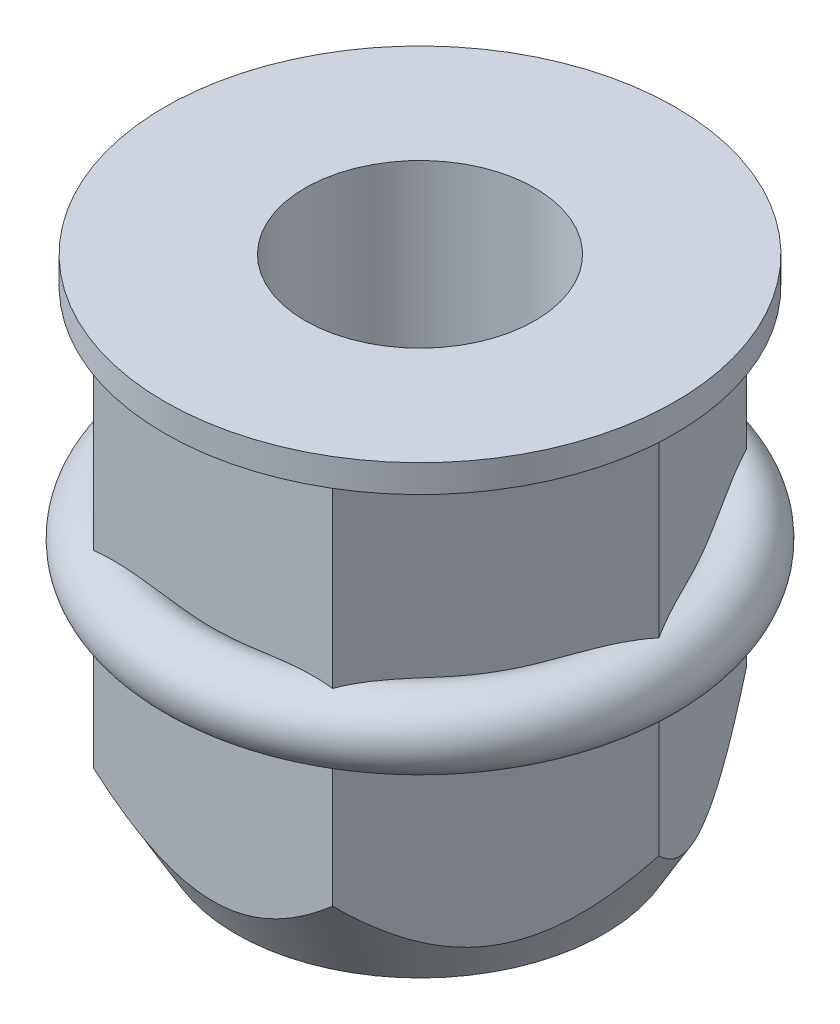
ISO-10303-21;
HEADER;
FILE_DESCRIPTION(('STEP AP214'),'2;1');
FILE_NAME('part.step','',(''),(''),'','','');
FILE_SCHEMA(('AUTOMOTIVE_DESIGN { 1 0 10303 214 1 1 1 1 }'));
ENDSEC;
DATA;
#1=APPLICATION_CONTEXT('core data for automotive mechanical design processes');
#2=APPLICATION_PROTOCOL_DEFINITION('international standard','automotive_design',2000,#1);
#3=PRODUCT_CONTEXT('',#1,'mechanical');
#4=PRODUCT('Part','Part','',(#3));
#5=PRODUCT_RELATED_PRODUCT_CATEGORY('part','',(#4));
#6=PRODUCT_DEFINITION_FORMATION('','',#4);
#7=PRODUCT_DEFINITION_CONTEXT('part definition',#1,'design');
#8=PRODUCT_DEFINITION('design','',#6,#7);
#9=PRODUCT_DEFINITION_SHAPE('','',#8);
#10=(LENGTH_UNIT() NAMED_UNIT(*) SI_UNIT(.MILLI.,.METRE.));
#11=(NAMED_UNIT(*) PLANE_ANGLE_UNIT() SI_UNIT($,.RADIAN.));
#12=(NAMED_UNIT(*) SI_UNIT($,.STERADIAN.) SOLID_ANGLE_UNIT());
#13=UNCERTAINTY_MEASURE_WITH_UNIT(LENGTH_MEASURE(1.E-05),#10,'distance_accuracy_value','');
#14=(GEOMETRIC_REPRESENTATION_CONTEXT(3) GLOBAL_UNCERTAINTY_ASSIGNED_CONTEXT((#13)) GLOBAL_UNIT_ASSIGNED_CONTEXT((#10,
#11,#12)) REPRESENTATION_CONTEXT('',''));
#15=CARTESIAN_POINT('',(0.,0.,0.));
#16=DIRECTION('',(0.,0.,1.));
#17=DIRECTION('',(1.,0.,0.));
#18=AXIS2_PLACEMENT_3D('',#15,#16,#17);
#19=CARTESIAN_POINT('',(-2.59807621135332,10.2,-4.5));
#20=DIRECTION('',(0.866025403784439,0.,0.5));
#21=DIRECTION('',(0.5,0.,-0.866025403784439));
#22=AXIS2_PLACEMENT_3D('',#19,#20,#21);
#23=PLANE('',#22);
#24=CARTESIAN_POINT('',(-5.19626789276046,6.17386387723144,0.000199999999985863));
#25=CARTESIAN_POINT('',(-5.17058660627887,6.18081408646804,-0.0442812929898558));
#26=CARTESIAN_POINT('',(-5.14481227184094,6.18619538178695,-0.0889237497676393));
#27=CARTESIAN_POINT('',(-5.09317836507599,6.19423966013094,-0.178356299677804));
#28=CARTESIAN_POINT('',(-5.06731888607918,6.19690499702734,-0.223146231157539));
#29=CARTESIAN_POINT('',(-5.01566821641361,6.19994173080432,-0.312607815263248));
#30=CARTESIAN_POINT('',(-4.98987713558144,6.20032173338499,-0.357279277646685));
#31=CARTESIAN_POINT('',(-4.9383014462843,6.19916259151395,-0.44661099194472));
#32=CARTESIAN_POINT('',(-4.91251684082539,6.19762298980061,-0.491271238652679));
#33=CARTESIAN_POINT('',(-4.83528907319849,6.19061986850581,-0.625033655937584));
#34=CARTESIAN_POINT('',(-4.7839013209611,6.18277435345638,-0.714039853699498));
#35=CARTESIAN_POINT('',(-4.68128403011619,6.1630296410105,-0.891778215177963));
#36=CARTESIAN_POINT('',(-4.63005472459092,6.15112604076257,-0.9805099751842));
#37=CARTESIAN_POINT('',(-4.51326344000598,6.12179689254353,-1.18279841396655));
#38=CARTESIAN_POINT('',(-4.44774222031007,6.10376148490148,-1.29628449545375));
#39=CARTESIAN_POINT('',(-4.31659287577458,6.06933316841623,-1.52344182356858));
#40=CARTESIAN_POINT('',(-4.25096477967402,6.05293987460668,-1.63711302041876));
#41=CARTESIAN_POINT('',(-4.15221785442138,6.03323866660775,-1.80814771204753));
#42=CARTESIAN_POINT('',(-4.11922724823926,6.02748397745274,-1.86528911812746));
#43=CARTESIAN_POINT('',(-4.05316870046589,6.01813462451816,-1.97970587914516));
#44=CARTESIAN_POINT('',(-4.02010076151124,6.01453988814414,-2.03698122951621));
#45=CARTESIAN_POINT('',(-3.95394750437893,6.00987721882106,-2.15156203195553));
#46=CARTESIAN_POINT('',(-3.92086222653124,6.00880708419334,-2.20886741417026));
#47=CARTESIAN_POINT('',(-3.85469792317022,6.00929617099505,-2.32346734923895));
#48=CARTESIAN_POINT('',(-3.82161889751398,6.01085532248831,-2.38076190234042));
#49=CARTESIAN_POINT('',(-3.73970143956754,6.01779260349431,-2.52264710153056));
#50=CARTESIAN_POINT('',(-3.69089440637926,6.02464089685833,-2.60718336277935));
#51=CARTESIAN_POINT('',(-3.59346487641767,6.04234502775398,-2.77593625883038));
#52=CARTESIAN_POINT('',(-3.5448424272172,6.05320183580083,-2.86015281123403));
#53=CARTESIAN_POINT('',(-3.44765858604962,6.0769842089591,-3.02848016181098));
#54=CARTESIAN_POINT('',(-3.39909738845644,6.08991278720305,-3.11259062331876));
#55=CARTESIAN_POINT('',(-3.30196919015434,6.11583869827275,-3.28082159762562));
#56=CARTESIAN_POINT('',(-3.25340219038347,6.12883604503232,-3.36494210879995));
#57=CARTESIAN_POINT('',(-3.15456268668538,6.15338895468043,-3.53613715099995));
#58=CARTESIAN_POINT('',(-3.104286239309,6.1648836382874,-3.62321851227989));
#59=CARTESIAN_POINT('',(-3.00357477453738,6.18385434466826,-3.79765588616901));
#60=CARTESIAN_POINT('',(-2.95313996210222,6.19133431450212,-3.88501154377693));
#61=CARTESIAN_POINT('',(-2.87726910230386,6.19791712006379,-4.01642372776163));
#62=CARTESIAN_POINT('',(-2.85188442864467,6.19933643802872,-4.0603912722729));
#63=CARTESIAN_POINT('',(-2.80111023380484,6.20029879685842,-4.14833475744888));
#64=CARTESIAN_POINT('',(-2.77572071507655,6.19984226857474,-4.192310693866));
#65=CARTESIAN_POINT('',(-2.72487883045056,6.1967108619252,-4.28037142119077));
#66=CARTESIAN_POINT('',(-2.69942657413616,6.19402787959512,-4.32445602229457));
#67=CARTESIAN_POINT('',(-2.64860622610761,6.18602623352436,-4.41247944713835));
#68=CARTESIAN_POINT('',(-2.62323822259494,6.18070536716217,-4.45641811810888));
#69=CARTESIAN_POINT('',(-2.59796074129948,6.17386387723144,-4.5002));
#70=B_SPLINE_CURVE_WITH_KNOTS('',3,(#24,#25,#26,#27,#28,#29,#30,#31,#32,#33,#34,#35,#36,#37,#38,
#39,#40,#41,#42,#43,#44,#45,#46,#47,#48,#49,#50,#51,#52,#53,#54,#55,#56,#57,#58,#59,#60,#61,#62,
#63,#64,#65,#66,#67,#68,#69),.UNSPECIFIED.,.F.,.F.,(4,2,2,2,2,2,2,2,2,2,2,2,2,2,2,2,2,2,2,2,2,2,
4),(0.,0.155430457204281,0.31072609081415,0.465436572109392,0.620183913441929,0.929255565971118,
1.23866362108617,1.63550741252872,2.03225795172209,2.23092315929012,2.42958168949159,
2.62806690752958,2.82654684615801,3.11997979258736,3.41348382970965,3.70741867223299,
4.00141554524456,4.30500494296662,4.60829531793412,4.76063459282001,4.91293887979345,
5.06579997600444,5.21878892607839),.UNSPECIFIED.);
#71=CARTESIAN_POINT('',(-5.19615242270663,6.17389517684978,0.));
#72=VERTEX_POINT('',#71);
#73=CARTESIAN_POINT('',(-2.59807621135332,6.17389517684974,-4.5));
#74=VERTEX_POINT('',#73);
#75=EDGE_CURVE('E60',#72,#74,#70,.T.);
#76=ORIENTED_EDGE('',*,*,#75,.F.);
#77=DIRECTION('',(0.,-1.,0.));
#78=VECTOR('',#77,1.);
#79=CARTESIAN_POINT('',(-5.19615242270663,10.2,0.));
#80=LINE('',#79,#78);
#81=CARTESIAN_POINT('',(-5.19615242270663,10.2,0.));
#82=VERTEX_POINT('',#81);
#83=EDGE_CURVE('E155',#82,#72,#80,.T.);
#84=ORIENTED_EDGE('',*,*,#83,.F.);
#85=DIRECTION('',(-0.5,0.,0.866025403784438));
#86=VECTOR('',#85,1.);
#87=CARTESIAN_POINT('',(-2.59807621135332,10.2,-4.5));
#88=LINE('',#87,#86);
#89=CARTESIAN_POINT('',(-2.59807621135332,10.2,-4.5));
#90=VERTEX_POINT('',#89);
#91=EDGE_CURVE('E323',#90,#82,#88,.T.);
#92=ORIENTED_EDGE('',*,*,#91,.F.);
#93=DIRECTION('',(0.,-1.,0.));
#94=VECTOR('',#93,1.);
#95=CARTESIAN_POINT('',(-2.59807621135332,10.2,-4.5));
#96=LINE('',#95,#94);
#97=EDGE_CURVE('E307',#90,#74,#96,.T.);
#98=ORIENTED_EDGE('',*,*,#97,.T.);
#99=EDGE_LOOP('',(#76,#84,#92,#98));
#100=FACE_BOUND('',#99,.T.);
#101=ADVANCED_FACE('F33',(#100),#23,.F.);
#102=CARTESIAN_POINT('',(-2.59796074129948,4.72613612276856,-4.5002));
#103=CARTESIAN_POINT('',(-2.62364202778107,4.71918591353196,-4.45571870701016));
#104=CARTESIAN_POINT('',(-2.649416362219,4.71380461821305,-4.41107625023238));
#105=CARTESIAN_POINT('',(-2.70105026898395,4.70576033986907,-4.32164370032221));
#106=CARTESIAN_POINT('',(-2.72690974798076,4.70309500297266,-4.27685376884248));
#107=CARTESIAN_POINT('',(-2.77856041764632,4.70005826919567,-4.18739218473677));
#108=CARTESIAN_POINT('',(-2.80435149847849,4.69967826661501,-4.14272072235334));
#109=CARTESIAN_POINT('',(-2.85592718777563,4.70083740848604,-4.0533890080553));
#110=CARTESIAN_POINT('',(-2.88171179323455,4.70237701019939,-4.00872876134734));
#111=CARTESIAN_POINT('',(-2.95893956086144,4.70938013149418,-3.87496634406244));
#112=CARTESIAN_POINT('',(-3.01032731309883,4.71722564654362,-3.78596014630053));
#113=CARTESIAN_POINT('',(-3.11294460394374,4.73697035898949,-3.60822178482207));
#114=CARTESIAN_POINT('',(-3.16417390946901,4.74887395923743,-3.51949002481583));
#115=CARTESIAN_POINT('',(-3.28096519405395,4.77820310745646,-3.31720158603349));
#116=CARTESIAN_POINT('',(-3.34648641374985,4.79623851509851,-3.20371550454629));
#117=CARTESIAN_POINT('',(-3.47763575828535,4.83066683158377,-2.97655817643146));
#118=CARTESIAN_POINT('',(-3.54326385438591,4.84706012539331,-2.86288697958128));
#119=CARTESIAN_POINT('',(-3.64201077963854,4.86676133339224,-2.69185228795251));
#120=CARTESIAN_POINT('',(-3.67500138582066,4.87251602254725,-2.63471088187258));
#121=CARTESIAN_POINT('',(-3.74105993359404,4.88186537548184,-2.52029412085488));
#122=CARTESIAN_POINT('',(-3.77412787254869,4.88546011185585,-2.46301877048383));
#123=CARTESIAN_POINT('',(-3.840281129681,4.89012278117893,-2.34843796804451));
#124=CARTESIAN_POINT('',(-3.87336640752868,4.89119291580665,-2.29113258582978));
#125=CARTESIAN_POINT('',(-3.93953071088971,4.89070382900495,-2.17653265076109));
#126=CARTESIAN_POINT('',(-3.97260973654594,4.88914467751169,-2.11923809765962));
#127=CARTESIAN_POINT('',(-4.05452719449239,4.88220739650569,-1.97735289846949));
#128=CARTESIAN_POINT('',(-4.10333422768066,4.87535910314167,-1.89281663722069));
#129=CARTESIAN_POINT('',(-4.20076375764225,4.85765497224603,-1.72406374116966));
#130=CARTESIAN_POINT('',(-4.24938620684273,4.84679816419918,-1.639847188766));
#131=CARTESIAN_POINT('',(-4.34657004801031,4.82301579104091,-1.47151983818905));
#132=CARTESIAN_POINT('',(-4.39513124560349,4.81008721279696,-1.38740937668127));
#133=CARTESIAN_POINT('',(-4.49225944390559,4.78416130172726,-1.21917840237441));
#134=CARTESIAN_POINT('',(-4.54082644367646,4.77116395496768,-1.13505789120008));
#135=CARTESIAN_POINT('',(-4.63966594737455,4.74661104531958,-0.963862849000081));
#136=CARTESIAN_POINT('',(-4.68994239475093,4.7351163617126,-0.876781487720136));
#137=CARTESIAN_POINT('',(-4.79065385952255,4.71614565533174,-0.702344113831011));
#138=CARTESIAN_POINT('',(-4.84108867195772,4.70866568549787,-0.614988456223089));
#139=CARTESIAN_POINT('',(-4.91695953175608,4.70208287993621,-0.483576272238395));
#140=CARTESIAN_POINT('',(-4.94234420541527,4.70066356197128,-0.43960872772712));
#141=CARTESIAN_POINT('',(-4.9931184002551,4.69970120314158,-0.351665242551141));
#142=CARTESIAN_POINT('',(-5.01850791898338,4.70015773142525,-0.307689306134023));
#143=CARTESIAN_POINT('',(-5.06934980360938,4.70328913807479,-0.21962857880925));
#144=CARTESIAN_POINT('',(-5.09480205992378,4.70597212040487,-0.175543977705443));
#145=CARTESIAN_POINT('',(-5.14562240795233,4.71397376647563,-0.0875205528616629));
#146=CARTESIAN_POINT('',(-5.170990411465,4.71929463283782,-0.0435818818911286));
#147=CARTESIAN_POINT('',(-5.19626789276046,4.72613612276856,0.000199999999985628));
#148=B_SPLINE_CURVE_WITH_KNOTS('',3,(#102,#103,#104,#105,#106,#107,#108,#109,#110,#111,#112,
#113,#114,#115,#116,#117,#118,#119,#120,#121,#122,#123,#124,#125,#126,#127,#128,#129,#130,#131,
#132,#133,#134,#135,#136,#137,#138,#139,#140,#141,#142,#143,#144,#145,#146,#147),.UNSPECIFIED.,
.F.,.F.,(4,2,2,2,2,2,2,2,2,2,2,2,2,2,2,2,2,2,2,2,2,2,4),(0.,0.155430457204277,0.310726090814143,
0.465436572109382,0.620183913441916,0.929255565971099,1.23866362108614,1.63550741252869,
2.03225795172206,2.23092315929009,2.42958168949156,2.62806690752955,2.82654684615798,
3.11997979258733,3.41348382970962,3.70741867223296,4.00141554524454,4.3050049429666,
4.60829531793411,4.76063459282,4.91293887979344,5.06579997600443,5.21878892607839),.UNSPECIFIED.);
#149=CARTESIAN_POINT('',(-2.59807621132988,4.72610482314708,-4.5));
#150=VERTEX_POINT('',#149);
#151=CARTESIAN_POINT('',(-5.19615242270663,4.72610482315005,0.));
#152=VERTEX_POINT('',#151);
#153=EDGE_CURVE('E270',#150,#152,#148,.T.);
#154=ORIENTED_EDGE('',*,*,#153,.F.);
#155=CARTESIAN_POINT('',(-2.59807621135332,2.07179676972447,-4.5));
#156=VERTEX_POINT('',#155);
#157=EDGE_CURVE('E308',#150,#156,#96,.T.);
#158=ORIENTED_EDGE('',*,*,#157,.T.);
#159=CARTESIAN_POINT('',(-5.19626789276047,2.07199677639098,0.000199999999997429));
#160=CARTESIAN_POINT('',(-5.16909415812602,2.02493217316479,-0.0468662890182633));
#161=CARTESIAN_POINT('',(-5.14164928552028,1.97849526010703,-0.0944022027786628));
#162=CARTESIAN_POINT('',(-5.08615758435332,1.88705179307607,-0.19051664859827));
#163=CARTESIAN_POINT('',(-5.05811058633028,1.84204565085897,-0.239095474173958));
#164=CARTESIAN_POINT('',(-4.97271136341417,1.70902576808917,-0.387011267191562));
#165=CARTESIAN_POINT('',(-4.91437665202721,1.62349396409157,-0.488049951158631));
#166=CARTESIAN_POINT('',(-4.79316606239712,1.45908489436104,-0.697992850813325));
#167=CARTESIAN_POINT('',(-4.73021179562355,1.38043665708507,-0.807032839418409));
#168=CARTESIAN_POINT('',(-4.60089288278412,1.23567505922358,-1.03101976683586));
#169=CARTESIAN_POINT('',(-4.53453620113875,1.16953398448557,-1.14595291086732));
#170=CARTESIAN_POINT('',(-4.42936514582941,1.08016790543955,-1.32811452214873));
#171=CARTESIAN_POINT('',(-4.39178193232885,1.05112233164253,-1.39321055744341));
#172=CARTESIAN_POINT('',(-4.31563113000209,0.998660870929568,-1.52510761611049));
#173=CARTESIAN_POINT('',(-4.27706346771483,0.975245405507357,-1.59190876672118));
#174=CARTESIAN_POINT('',(-4.19940398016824,0.934939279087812,-1.72641894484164));
#175=CARTESIAN_POINT('',(-4.16031872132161,0.917998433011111,-1.79411659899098));
#176=CARTESIAN_POINT('',(-4.08155994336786,0.890992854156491,-1.93053080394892));
#177=CARTESIAN_POINT('',(-4.04188653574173,0.880926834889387,-1.99924716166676));
#178=CARTESIAN_POINT('',(-3.9618751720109,0.868013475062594,-2.13783090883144));
#179=CARTESIAN_POINT('',(-3.92153446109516,0.86523351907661,-2.20770306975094));
#180=CARTESIAN_POINT('',(-3.84090047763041,0.867206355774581,-2.34736522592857));
#181=CARTESIAN_POINT('',(-3.80060720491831,0.87195912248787,-2.41715522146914));
#182=CARTESIAN_POINT('',(-3.72032020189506,0.88881478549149,-2.55621638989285));
#183=CARTESIAN_POINT('',(-3.6803273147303,0.900933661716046,-2.62548610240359));
#184=CARTESIAN_POINT('',(-3.60100661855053,0.932042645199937,-2.76287357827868));
#185=CARTESIAN_POINT('',(-3.5616792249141,0.951036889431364,-2.83099062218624));
#186=CARTESIAN_POINT('',(-3.42261934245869,1.03011820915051,-3.07184940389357));
#187=CARTESIAN_POINT('',(-3.32531357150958,1.10780646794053,-3.24038794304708));
#188=CARTESIAN_POINT('',(-3.18478709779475,1.24579738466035,-3.48378693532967));
#189=CARTESIAN_POINT('',(-3.13873517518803,1.2955318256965,-3.56355120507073));
#190=CARTESIAN_POINT('',(-3.04833141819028,1.40087530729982,-3.72013510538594));
#191=CARTESIAN_POINT('',(-3.00397930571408,1.45648338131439,-3.79695521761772));
#192=CARTESIAN_POINT('',(-2.89657409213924,1.59946581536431,-3.98298650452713));
#193=CARTESIAN_POINT('',(-2.834435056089,1.68956994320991,-4.0906144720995));
#194=CARTESIAN_POINT('',(-2.74378911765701,1.82983963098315,-4.24761784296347));
#195=CARTESIAN_POINT('',(-2.71416136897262,1.87716666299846,-4.29893460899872));
#196=CARTESIAN_POINT('',(-2.65557574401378,1.97342858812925,-4.40040788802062));
#197=CARTESIAN_POINT('',(-2.62661773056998,2.0223631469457,-4.45056463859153));
#198=CARTESIAN_POINT('',(-2.59796074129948,2.07199677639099,-4.5002));
#199=B_SPLINE_CURVE_WITH_KNOTS('',3,(#159,#160,#161,#162,#163,#164,#165,#166,#167,#168,#169,
#170,#171,#172,#173,#174,#175,#176,#177,#178,#179,#180,#181,#182,#183,#184,#185,#186,#187,#188,
#189,#190,#191,#192,#193,#194,#195,#196,#197,#198),.UNSPECIFIED.,.F.,.F.,(4,2,2,2,2,2,2,2,2,2,2,
2,2,2,2,2,2,2,2,4),(0.,0.215671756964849,0.431405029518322,0.865068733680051,1.30993694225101,
1.7538075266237,1.99537399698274,2.23695854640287,2.47663063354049,2.71625785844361,
2.95809356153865,3.1999284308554,3.44228981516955,3.6847972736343,4.30928540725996,
4.62320304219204,4.93706909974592,5.39716065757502,5.62464766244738,5.85208765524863),.UNSPECIFIED.);
#200=CARTESIAN_POINT('',(-5.19615242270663,2.07179676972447,0.));
#201=VERTEX_POINT('',#200);
#202=EDGE_CURVE('E210',#201,#156,#199,.T.);
#203=ORIENTED_EDGE('',*,*,#202,.F.);
#204=EDGE_CURVE('E161',#152,#201,#80,.T.);
#205=ORIENTED_EDGE('',*,*,#204,.F.);
#206=EDGE_LOOP('',(#154,#158,#203,#205));
#207=FACE_BOUND('',#206,.T.);
#208=ADVANCED_FACE('F219',(#207),#23,.F.);
#209=CARTESIAN_POINT('',(-5.19615242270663,10.2,0.));
#210=DIRECTION('',(0.866025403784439,0.,-0.5));
#211=DIRECTION('',(-0.5,0.,-0.866025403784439));
#212=AXIS2_PLACEMENT_3D('',#209,#210,#211);
#213=PLANE('',#212);
#214=CARTESIAN_POINT('',(-2.59796074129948,6.17386387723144,4.5002));
#215=CARTESIAN_POINT('',(-2.62364202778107,6.18081408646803,4.45571870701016));
#216=CARTESIAN_POINT('',(-2.64941636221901,6.18619538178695,4.41107625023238));
#217=CARTESIAN_POINT('',(-2.70105026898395,6.19423966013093,4.32164370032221));
#218=CARTESIAN_POINT('',(-2.72690974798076,6.19690499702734,4.27685376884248));
#219=CARTESIAN_POINT('',(-2.77856041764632,6.19994173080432,4.18739218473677));
#220=CARTESIAN_POINT('',(-2.80435149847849,6.20032173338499,4.14272072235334));
#221=CARTESIAN_POINT('',(-2.85592718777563,6.19916259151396,4.0533890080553));
#222=CARTESIAN_POINT('',(-2.88171179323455,6.19762298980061,4.00872876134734));
#223=CARTESIAN_POINT('',(-2.95893956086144,6.19061986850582,3.87496634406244));
#224=CARTESIAN_POINT('',(-3.01032731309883,6.18277435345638,3.78596014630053));
#225=CARTESIAN_POINT('',(-3.11294460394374,6.16302964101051,3.60822178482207));
#226=CARTESIAN_POINT('',(-3.16417390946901,6.15112604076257,3.51949002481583));
#227=CARTESIAN_POINT('',(-3.28096519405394,6.12179689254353,3.31720158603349));
#228=CARTESIAN_POINT('',(-3.34648641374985,6.10376148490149,3.20371550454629));
#229=CARTESIAN_POINT('',(-3.47763575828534,6.06933316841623,2.97655817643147));
#230=CARTESIAN_POINT('',(-3.5432638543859,6.05293987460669,2.86288697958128));
#231=CARTESIAN_POINT('',(-3.64201077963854,6.03323866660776,2.69185228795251));
#232=CARTESIAN_POINT('',(-3.67500138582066,6.02748397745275,2.63471088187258));
#233=CARTESIAN_POINT('',(-3.74105993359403,6.01813462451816,2.52029412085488));
#234=CARTESIAN_POINT('',(-3.77412787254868,6.01453988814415,2.46301877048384));
#235=CARTESIAN_POINT('',(-3.84028112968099,6.00987721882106,2.34843796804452));
#236=CARTESIAN_POINT('',(-3.87336640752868,6.00880708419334,2.29113258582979));
#237=CARTESIAN_POINT('',(-3.9395307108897,6.00929617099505,2.1765326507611));
#238=CARTESIAN_POINT('',(-3.97260973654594,6.0108553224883,2.11923809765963));
#239=CARTESIAN_POINT('',(-4.05452719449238,6.01779260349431,1.97735289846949));
#240=CARTESIAN_POINT('',(-4.10333422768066,6.02464089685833,1.8928166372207));
#241=CARTESIAN_POINT('',(-4.20076375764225,6.04234502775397,1.72406374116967));
#242=CARTESIAN_POINT('',(-4.24938620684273,6.05320183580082,1.63984718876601));
#243=CARTESIAN_POINT('',(-4.3465700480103,6.07698420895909,1.47151983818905));
#244=CARTESIAN_POINT('',(-4.39513124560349,6.08991278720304,1.38740937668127));
#245=CARTESIAN_POINT('',(-4.49225944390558,6.11583869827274,1.21917840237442));
#246=CARTESIAN_POINT('',(-4.54082644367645,6.12883604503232,1.13505789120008));
#247=CARTESIAN_POINT('',(-4.63966594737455,6.15338895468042,0.963862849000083));
#248=CARTESIAN_POINT('',(-4.68994239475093,6.1648836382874,0.876781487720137));
#249=CARTESIAN_POINT('',(-4.79065385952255,6.18385434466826,0.702344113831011));
#250=CARTESIAN_POINT('',(-4.84108867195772,6.19133431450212,0.614988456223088));
#251=CARTESIAN_POINT('',(-4.91695953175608,6.19791712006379,0.483576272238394));
#252=CARTESIAN_POINT('',(-4.94234420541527,6.19933643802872,0.439608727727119));
#253=CARTESIAN_POINT('',(-4.99311840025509,6.20029879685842,0.351665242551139));
#254=CARTESIAN_POINT('',(-5.01850791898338,6.19984226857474,0.307689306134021));
#255=CARTESIAN_POINT('',(-5.06934980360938,6.1967108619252,0.219628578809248));
#256=CARTESIAN_POINT('',(-5.09480205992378,6.19402787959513,0.175543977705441));
#257=CARTESIAN_POINT('',(-5.14562240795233,6.18602623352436,0.0875205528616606));
#258=CARTESIAN_POINT('',(-5.170990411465,6.18070536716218,0.0435818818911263));
#259=CARTESIAN_POINT('',(-5.19626789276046,6.17386387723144,-0.000199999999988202));
#260=B_SPLINE_CURVE_WITH_KNOTS('',3,(#214,#215,#216,#217,#218,#219,#220,#221,#222,#223,#224,
#225,#226,#227,#228,#229,#230,#231,#232,#233,#234,#235,#236,#237,#238,#239,#240,#241,#242,#243,
#244,#245,#246,#247,#248,#249,#250,#251,#252,#253,#254,#255,#256,#257,#258,#259),.UNSPECIFIED.,
.F.,.F.,(4,2,2,2,2,2,2,2,2,2,2,2,2,2,2,2,2,2,2,2,2,2,4),(0.,0.155430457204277,0.310726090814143,
0.465436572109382,0.620183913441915,0.929255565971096,1.23866362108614,1.63550741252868,
2.03225795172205,2.23092315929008,2.42958168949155,2.62806690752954,2.82654684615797,
3.11997979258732,3.41348382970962,3.70741867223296,4.00141554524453,4.3050049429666,
4.60829531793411,4.76063459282,4.91293887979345,5.06579997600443,5.21878892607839),.UNSPECIFIED.);
#261=CARTESIAN_POINT('',(-2.59807621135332,6.17389517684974,4.5));
#262=VERTEX_POINT('',#261);
#263=EDGE_CURVE('E227',#262,#72,#260,.T.);
#264=ORIENTED_EDGE('',*,*,#263,.F.);
#265=DIRECTION('',(0.,-1.,0.));
#266=VECTOR('',#265,1.);
#267=CARTESIAN_POINT('',(-2.59807621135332,10.2,4.5));
#268=LINE('',#267,#266);
#269=CARTESIAN_POINT('',(-2.59807621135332,10.2,4.5));
#270=VERTEX_POINT('',#269);
#271=EDGE_CURVE('E285',#270,#262,#268,.T.);
#272=ORIENTED_EDGE('',*,*,#271,.F.);
#273=DIRECTION('',(0.5,0.,0.866025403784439));
#274=VECTOR('',#273,1.);
#275=CARTESIAN_POINT('',(-5.19615242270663,10.2,0.));
#276=LINE('',#275,#274);
#277=EDGE_CURVE('E320',#82,#270,#276,.T.);
#278=ORIENTED_EDGE('',*,*,#277,.F.);
#279=ORIENTED_EDGE('',*,*,#83,.T.);
#280=EDGE_LOOP('',(#264,#272,#278,#279));
#281=FACE_BOUND('',#280,.T.);
#282=ADVANCED_FACE('F215',(#281),#213,.F.);
#283=CARTESIAN_POINT('',(-5.19626789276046,4.72613612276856,-0.000199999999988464));
#284=CARTESIAN_POINT('',(-5.17058660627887,4.71918591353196,0.0442812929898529));
#285=CARTESIAN_POINT('',(-5.14481227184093,4.71380461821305,0.0889237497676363));
#286=CARTESIAN_POINT('',(-5.09317836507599,4.70576033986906,0.178356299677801));
#287=CARTESIAN_POINT('',(-5.06731888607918,4.70309500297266,0.223146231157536));
#288=CARTESIAN_POINT('',(-5.01566821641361,4.70005826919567,0.312607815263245));
#289=CARTESIAN_POINT('',(-4.98987713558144,4.69967826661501,0.357279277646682));
#290=CARTESIAN_POINT('',(-4.9383014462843,4.70083740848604,0.446610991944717));
#291=CARTESIAN_POINT('',(-4.91251684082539,4.70237701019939,0.491271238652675));
#292=CARTESIAN_POINT('',(-4.83528907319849,4.70938013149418,0.62503365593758));
#293=CARTESIAN_POINT('',(-4.78390132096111,4.71722564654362,0.714039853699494));
#294=CARTESIAN_POINT('',(-4.68128403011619,4.7369703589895,0.891778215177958));
#295=CARTESIAN_POINT('',(-4.63005472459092,4.74887395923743,0.980509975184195));
#296=CARTESIAN_POINT('',(-4.51326344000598,4.77820310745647,1.18279841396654));
#297=CARTESIAN_POINT('',(-4.44774222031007,4.79623851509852,1.29628449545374));
#298=CARTESIAN_POINT('',(-4.31659287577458,4.83066683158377,1.52344182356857));
#299=CARTESIAN_POINT('',(-4.25096477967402,4.84706012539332,1.63711302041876));
#300=CARTESIAN_POINT('',(-4.15221785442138,4.86676133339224,1.80814771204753));
#301=CARTESIAN_POINT('',(-4.11922724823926,4.87251602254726,1.86528911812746));
#302=CARTESIAN_POINT('',(-4.05316870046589,4.88186537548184,1.97970587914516));
#303=CARTESIAN_POINT('',(-4.02010076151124,4.88546011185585,2.0369812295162));
#304=CARTESIAN_POINT('',(-3.95394750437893,4.89012278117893,2.15156203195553));
#305=CARTESIAN_POINT('',(-3.92086222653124,4.89119291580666,2.20886741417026));
#306=CARTESIAN_POINT('',(-3.85469792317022,4.89070382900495,2.32346734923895));
#307=CARTESIAN_POINT('',(-3.82161889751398,4.88914467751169,2.38076190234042));
#308=CARTESIAN_POINT('',(-3.73970143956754,4.88220739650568,2.52264710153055));
#309=CARTESIAN_POINT('',(-3.69089440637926,4.87535910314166,2.60718336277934));
#310=CARTESIAN_POINT('',(-3.59346487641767,4.85765497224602,2.77593625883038));
#311=CARTESIAN_POINT('',(-3.5448424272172,4.84679816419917,2.86015281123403));
#312=CARTESIAN_POINT('',(-3.44765858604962,4.8230157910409,3.02848016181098));
#313=CARTESIAN_POINT('',(-3.39909738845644,4.81008721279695,3.11259062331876));
#314=CARTESIAN_POINT('',(-3.30196919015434,4.78416130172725,3.28082159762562));
#315=CARTESIAN_POINT('',(-3.25340219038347,4.77116395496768,3.36494210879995));
#316=CARTESIAN_POINT('',(-3.15456268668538,4.74661104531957,3.53613715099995));
#317=CARTESIAN_POINT('',(-3.104286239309,4.73511636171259,3.62321851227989));
#318=CARTESIAN_POINT('',(-3.00357477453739,4.71614565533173,3.79765588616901));
#319=CARTESIAN_POINT('',(-2.95313996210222,4.70866568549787,3.88501154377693));
#320=CARTESIAN_POINT('',(-2.87726910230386,4.70208287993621,4.01642372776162));
#321=CARTESIAN_POINT('',(-2.85188442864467,4.70066356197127,4.0603912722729));
#322=CARTESIAN_POINT('',(-2.80111023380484,4.69970120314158,4.14833475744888));
#323=CARTESIAN_POINT('',(-2.77572071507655,4.70015773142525,4.19231069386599));
#324=CARTESIAN_POINT('',(-2.72487883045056,4.7032891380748,4.28037142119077));
#325=CARTESIAN_POINT('',(-2.69942657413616,4.70597212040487,4.32445602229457));
#326=CARTESIAN_POINT('',(-2.64860622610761,4.71397376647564,4.41247944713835));
#327=CARTESIAN_POINT('',(-2.62323822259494,4.71929463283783,4.45641811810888));
#328=CARTESIAN_POINT('',(-2.59796074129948,4.72613612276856,4.5002));
#329=B_SPLINE_CURVE_WITH_KNOTS('',3,(#283,#284,#285,#286,#287,#288,#289,#290,#291,#292,#293,
#294,#295,#296,#297,#298,#299,#300,#301,#302,#303,#304,#305,#306,#307,#308,#309,#310,#311,#312,
#313,#314,#315,#316,#317,#318,#319,#320,#321,#322,#323,#324,#325,#326,#327,#328),.UNSPECIFIED.,
.F.,.F.,(4,2,2,2,2,2,2,2,2,2,2,2,2,2,2,2,2,2,2,2,2,2,4),(0.,0.155430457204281,0.310726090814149,
0.465436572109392,0.620183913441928,0.929255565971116,1.23866362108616,1.63550741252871,
2.03225795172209,2.23092315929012,2.42958168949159,2.62806690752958,2.82654684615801,
3.11997979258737,3.41348382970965,3.70741867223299,4.00141554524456,4.30500494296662,
4.60829531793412,4.76063459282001,4.91293887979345,5.06579997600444,5.21878892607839),.UNSPECIFIED.);
#330=CARTESIAN_POINT('',(-2.59807621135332,4.72610482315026,4.5));
#331=VERTEX_POINT('',#330);
#332=EDGE_CURVE('E52',#152,#331,#329,.T.);
#333=ORIENTED_EDGE('',*,*,#332,.F.);
#334=ORIENTED_EDGE('',*,*,#204,.T.);
#335=CARTESIAN_POINT('',(-2.59796074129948,2.07199677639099,4.5002));
#336=CARTESIAN_POINT('',(-2.62513447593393,2.02493217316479,4.45313371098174));
#337=CARTESIAN_POINT('',(-2.65257934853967,1.97849526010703,4.40559779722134));
#338=CARTESIAN_POINT('',(-2.70807104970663,1.88705179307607,4.30948335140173));
#339=CARTESIAN_POINT('',(-2.73611804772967,1.84204565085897,4.26090452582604));
#340=CARTESIAN_POINT('',(-2.82151727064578,1.70902576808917,4.11298873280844));
#341=CARTESIAN_POINT('',(-2.87985198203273,1.62349396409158,4.01195004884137));
#342=CARTESIAN_POINT('',(-3.00106257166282,1.45908489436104,3.80200714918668));
#343=CARTESIAN_POINT('',(-3.0640168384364,1.38043665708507,3.69296716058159));
#344=CARTESIAN_POINT('',(-3.19333575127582,1.23567505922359,3.46898023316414));
#345=CARTESIAN_POINT('',(-3.25969243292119,1.16953398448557,3.35404708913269));
#346=CARTESIAN_POINT('',(-3.36486348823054,1.08016790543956,3.17188547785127));
#347=CARTESIAN_POINT('',(-3.4024467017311,1.05112233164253,3.10678944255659));
#348=CARTESIAN_POINT('',(-3.47859750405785,0.998660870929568,2.97489238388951));
#349=CARTESIAN_POINT('',(-3.51716516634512,0.975245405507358,2.90809123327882));
#350=CARTESIAN_POINT('',(-3.59482465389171,0.934939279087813,2.77358105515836));
#351=CARTESIAN_POINT('',(-3.63390991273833,0.917998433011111,2.70588340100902));
#352=CARTESIAN_POINT('',(-3.71266869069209,0.89099285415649,2.56946919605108));
#353=CARTESIAN_POINT('',(-3.75234209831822,0.880926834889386,2.50075283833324));
#354=CARTESIAN_POINT('',(-3.83235346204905,0.868013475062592,2.36216909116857));
#355=CARTESIAN_POINT('',(-3.87269417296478,0.865233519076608,2.29229693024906));
#356=CARTESIAN_POINT('',(-3.95332815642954,0.867206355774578,2.15263477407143));
#357=CARTESIAN_POINT('',(-3.99362142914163,0.871959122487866,2.08284477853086));
#358=CARTESIAN_POINT('',(-4.07390843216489,0.888814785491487,1.94378361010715));
#359=CARTESIAN_POINT('',(-4.11390131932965,0.900933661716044,1.87451389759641));
#360=CARTESIAN_POINT('',(-4.19322201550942,0.932042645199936,1.73712642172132));
#361=CARTESIAN_POINT('',(-4.23254940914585,0.951036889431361,1.66900937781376));
#362=CARTESIAN_POINT('',(-4.37160929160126,1.0301182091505,1.42815059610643));
#363=CARTESIAN_POINT('',(-4.46891506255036,1.10780646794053,1.25961205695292));
#364=CARTESIAN_POINT('',(-4.6094415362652,1.24579738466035,1.01621306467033));
#365=CARTESIAN_POINT('',(-4.65549345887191,1.2955318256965,0.936448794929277));
#366=CARTESIAN_POINT('',(-4.74589721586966,1.40087530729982,0.779864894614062));
#367=CARTESIAN_POINT('',(-4.79024932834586,1.45648338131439,0.703044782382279));
#368=CARTESIAN_POINT('',(-4.8976545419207,1.59946581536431,0.517013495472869));
#369=CARTESIAN_POINT('',(-4.95979357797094,1.6895699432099,0.409385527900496));
#370=CARTESIAN_POINT('',(-5.05043951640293,1.82983963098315,0.252382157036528));
#371=CARTESIAN_POINT('',(-5.08006726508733,1.87716666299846,0.201065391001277));
#372=CARTESIAN_POINT('',(-5.13865289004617,1.97342858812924,0.099592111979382));
#373=CARTESIAN_POINT('',(-5.16761090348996,2.0223631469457,0.0494353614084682));
#374=CARTESIAN_POINT('',(-5.19626789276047,2.07199677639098,-0.000200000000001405));
#375=B_SPLINE_CURVE_WITH_KNOTS('',3,(#335,#336,#337,#338,#339,#340,#341,#342,#343,#344,#345,
#346,#347,#348,#349,#350,#351,#352,#353,#354,#355,#356,#357,#358,#359,#360,#361,#362,#363,#364,
#365,#366,#367,#368,#369,#370,#371,#372,#373,#374),.UNSPECIFIED.,.F.,.F.,(4,2,2,2,2,2,2,2,2,2,2,
2,2,2,2,2,2,2,2,4),(0.,0.215671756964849,0.431405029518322,0.86506873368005,1.30993694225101,
1.7538075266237,1.99537399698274,2.23695854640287,2.47663063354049,2.71625785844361,
2.95809356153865,3.1999284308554,3.44228981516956,3.6847972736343,4.30928540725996,
4.62320304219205,4.93706909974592,5.39716065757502,5.62464766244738,5.85208765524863),.UNSPECIFIED.);
#376=CARTESIAN_POINT('',(-2.59807621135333,2.07179676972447,4.5));
#377=VERTEX_POINT('',#376);
#378=EDGE_CURVE('E205',#377,#201,#375,.T.);
#379=ORIENTED_EDGE('',*,*,#378,.F.);
#380=EDGE_CURVE('E283',#331,#377,#268,.T.);
#381=ORIENTED_EDGE('',*,*,#380,.F.);
#382=EDGE_LOOP('',(#333,#334,#379,#381));
#383=FACE_BOUND('',#382,.T.);
#384=ADVANCED_FACE('F218',(#383),#213,.F.);
#385=CARTESIAN_POINT('',(-2.59807621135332,10.2,4.5));
#386=DIRECTION('',(0.,0.,-1.));
#387=DIRECTION('',(-1.,0.,0.));
#388=AXIS2_PLACEMENT_3D('',#385,#386,#387);
#389=PLANE('',#388);
#390=CARTESIAN_POINT('',(0.,6.00901699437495,4.5));
#391=CARTESIAN_POINT('',(-0.0625153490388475,6.00901391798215,4.5));
#392=CARTESIAN_POINT('',(-0.1250283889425,6.01019169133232,4.5));
#393=CARTESIAN_POINT('',(-0.249974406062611,6.01477829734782,4.5));
#394=CARTESIAN_POINT('',(-0.312407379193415,6.01818723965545,4.5));
#395=CARTESIAN_POINT('',(-0.499691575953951,6.03134870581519,4.5));
#396=CARTESIAN_POINT('',(-0.624329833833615,6.04403433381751,4.5));
#397=CARTESIAN_POINT('',(-0.874121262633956,6.07351635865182,4.5));
#398=CARTESIAN_POINT('',(-0.999269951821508,6.09034642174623,4.5));
#399=CARTESIAN_POINT('',(-1.24952601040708,6.1237429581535,4.5));
#400=CARTESIAN_POINT('',(-1.37463334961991,6.14030960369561,4.5));
#401=CARTESIAN_POINT('',(-1.59088525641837,6.16520927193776,4.5));
#402=CARTESIAN_POINT('',(-1.68190679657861,6.17455364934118,4.5));
#403=CARTESIAN_POINT('',(-1.86432672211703,6.18947153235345,4.5));
#404=CARTESIAN_POINT('',(-1.95572528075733,6.19504304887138,4.5));
#405=CARTESIAN_POINT('',(-2.13837765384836,6.20072853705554,4.5));
#406=CARTESIAN_POINT('',(-2.22963066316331,6.20086351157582,4.5));
#407=CARTESIAN_POINT('',(-2.41179207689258,6.19380623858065,4.5));
#408=CARTESIAN_POINT('',(-2.50270075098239,6.18662210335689,4.5));
#409=CARTESIAN_POINT('',(-2.68425023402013,6.16240635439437,4.5));
#410=CARTESIAN_POINT('',(-2.77488016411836,6.14528120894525,4.5));
#411=CARTESIAN_POINT('',(-2.90808767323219,6.10970522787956,4.5));
#412=CARTESIAN_POINT('',(-2.9519915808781,6.09621686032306,4.5));
#413=CARTESIAN_POINT('',(-3.03842324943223,6.06542001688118,4.5));
#414=CARTESIAN_POINT('',(-3.0809521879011,6.04811491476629,4.5));
#415=CARTESIAN_POINT('',(-3.16347226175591,6.00931636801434,4.5));
#416=CARTESIAN_POINT('',(-3.20348744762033,5.98787483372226,4.5));
#417=CARTESIAN_POINT('',(-3.2804938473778,5.94003357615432,4.5));
#418=CARTESIAN_POINT('',(-3.31748607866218,5.9136355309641,4.5));
#419=CARTESIAN_POINT('',(-3.38143293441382,5.85988277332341,4.5));
#420=CARTESIAN_POINT('',(-3.40905193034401,5.83332724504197,4.5));
#421=CARTESIAN_POINT('',(-3.45966686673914,5.77610568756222,4.5));
#422=CARTESIAN_POINT('',(-3.4826707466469,5.74544687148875,4.5));
#423=CARTESIAN_POINT('',(-3.51759890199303,5.68811908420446,4.5));
#424=CARTESIAN_POINT('',(-3.53085727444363,5.66226677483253,4.5));
#425=CARTESIAN_POINT('',(-3.55294972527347,5.60872484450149,4.5));
#426=CARTESIAN_POINT('',(-3.5617870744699,5.58103659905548,4.5));
#427=CARTESIAN_POINT('',(-3.57440942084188,5.52433774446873,4.5));
#428=CARTESIAN_POINT('',(-3.57816383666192,5.4953202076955,4.5));
#429=CARTESIAN_POINT('',(-3.58018397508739,5.43709521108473,4.5));
#430=CARTESIAN_POINT('',(-3.57845096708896,5.40788779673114,4.5));
#431=CARTESIAN_POINT('',(-3.57006367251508,5.35293272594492,4.5));
#432=CARTESIAN_POINT('',(-3.56387202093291,5.32711225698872,4.5));
#433=CARTESIAN_POINT('',(-3.54752260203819,5.27676995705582,4.5));
#434=CARTESIAN_POINT('',(-3.53736342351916,5.25224859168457,4.5));
#435=CARTESIAN_POINT('',(-3.50973465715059,5.1971087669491,4.5));
#436=CARTESIAN_POINT('',(-3.49095915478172,5.16714556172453,4.5));
#437=CARTESIAN_POINT('',(-3.44880595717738,5.11066352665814,4.5));
#438=CARTESIAN_POINT('',(-3.42541983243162,5.08415115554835,4.5));
#439=CARTESIAN_POINT('',(-3.36403861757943,5.02349969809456,4.5));
#440=CARTESIAN_POINT('',(-3.32418685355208,4.9912508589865,4.5));
#441=CARTESIAN_POINT('',(-3.2400021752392,4.93328629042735,4.5));
#442=CARTESIAN_POINT('',(-3.19565918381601,4.90758572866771,4.5));
#443=CARTESIAN_POINT('',(-3.11170046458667,4.86560693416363,4.5));
#444=CARTESIAN_POINT('',(-3.07250207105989,4.84847468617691,4.5));
#445=CARTESIAN_POINT('',(-2.99275668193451,4.81766540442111,4.5));
#446=CARTESIAN_POINT('',(-2.95220874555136,4.80399084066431,4.5));
#447=CARTESIAN_POINT('',(-2.82925013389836,4.76749351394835,4.5));
#448=CARTESIAN_POINT('',(-2.74550118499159,4.74918622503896,4.5));
#449=CARTESIAN_POINT('',(-2.55148704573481,4.71767903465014,4.5));
#450=CARTESIAN_POINT('',(-2.44075389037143,4.70762458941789,4.5));
#451=CARTESIAN_POINT('',(-2.21874906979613,4.69843046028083,4.5));
#452=CARTESIAN_POINT('',(-2.1074767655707,4.6993132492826,4.5));
#453=CARTESIAN_POINT('',(-1.88438896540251,4.70865879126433,4.5));
#454=CARTESIAN_POINT('',(-1.77257664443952,4.71718450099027,4.5));
#455=CARTESIAN_POINT('',(-1.54950796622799,4.73893174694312,4.5));
#456=CARTESIAN_POINT('',(-1.43825135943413,4.75215093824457,4.5));
#457=CARTESIAN_POINT('',(-1.17166106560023,4.78617566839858,4.5));
#458=CARTESIAN_POINT('',(-1.01645123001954,4.80790375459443,4.5));
#459=CARTESIAN_POINT('',(-0.783263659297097,4.83734869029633,4.5));
#460=CARTESIAN_POINT('',(-0.705493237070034,4.84663706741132,4.5));
#461=CARTESIAN_POINT('',(-0.549736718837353,4.86313804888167,4.5));
#462=CARTESIAN_POINT('',(-0.47175066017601,4.87035099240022,4.5));
#463=CARTESIAN_POINT('',(-0.316031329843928,4.88176408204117,4.5));
#464=CARTESIAN_POINT('',(-0.238299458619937,4.88598250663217,4.5));
#465=CARTESIAN_POINT('',(-0.0827243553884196,4.89089047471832,4.5));
#466=CARTESIAN_POINT('',(-0.00488113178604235,4.89158027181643,4.5));
#467=CARTESIAN_POINT('',(0.150758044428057,4.88932951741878,4.5));
#468=CARTESIAN_POINT('',(0.228553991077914,4.88638857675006,4.5));
#469=CARTESIAN_POINT('',(0.383959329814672,4.87729973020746,4.5));
#470=CARTESIAN_POINT('',(0.461568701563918,4.8711514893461,4.5));
#471=CARTESIAN_POINT('',(0.693910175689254,4.84909220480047,4.5));
#472=CARTESIAN_POINT('',(0.848275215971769,4.82956272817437,4.5));
#473=CARTESIAN_POINT('',(1.1569334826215,4.78877674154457,4.5));
#474=CARTESIAN_POINT('',(1.31122629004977,4.76751779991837,4.5));
#475=CARTESIAN_POINT('',(1.62043325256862,4.73096527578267,4.5));
#476=CARTESIAN_POINT('',(1.77534614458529,4.71566288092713,4.5));
#477=CARTESIAN_POINT('',(2.00816237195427,4.70290376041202,4.5));
#478=CARTESIAN_POINT('',(2.08576271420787,4.70034722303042,4.5));
#479=CARTESIAN_POINT('',(2.2409689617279,4.69971792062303,4.5));
#480=CARTESIAN_POINT('',(2.31857483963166,4.70164264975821,4.5));
#481=CARTESIAN_POINT('',(2.44322942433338,4.70937590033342,4.5));
#482=CARTESIAN_POINT('',(2.49038981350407,4.71337667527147,4.5));
#483=CARTESIAN_POINT('',(2.5844576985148,4.72386833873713,4.5));
#484=CARTESIAN_POINT('',(2.63136509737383,4.73036012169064,4.5));
#485=CARTESIAN_POINT('',(2.72470521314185,4.74622808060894,4.5));
#486=CARTESIAN_POINT('',(2.77113787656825,4.7556045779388,4.5));
#487=CARTESIAN_POINT('',(2.86318712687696,4.77769832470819,4.5));
#488=CARTESIAN_POINT('',(2.90880411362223,4.79041388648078,4.5));
#489=CARTESIAN_POINT('',(3.01019153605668,4.82343598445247,4.5));
#490=CARTESIAN_POINT('',(3.06561191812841,4.84484903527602,4.5));
#491=CARTESIAN_POINT('',(3.17304931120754,4.89502013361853,4.5));
#492=CARTESIAN_POINT('',(3.22507180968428,4.92376595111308,4.5));
#493=CARTESIAN_POINT('',(3.30850668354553,4.98002138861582,4.5));
#494=CARTESIAN_POINT('',(3.34141095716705,5.00530101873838,4.5));
#495=CARTESIAN_POINT('',(3.40304626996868,5.06055215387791,4.5));
#496=CARTESIAN_POINT('',(3.43178358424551,5.09051645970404,4.5));
#497=CARTESIAN_POINT('',(3.47702470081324,5.1473859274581,4.5));
#498=CARTESIAN_POINT('',(3.49480493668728,5.17326910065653,4.5));
#499=CARTESIAN_POINT('',(3.52596221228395,5.2275866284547,4.5));
#500=CARTESIAN_POINT('',(3.53934207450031,5.25601933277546,4.5));
#501=CARTESIAN_POINT('',(3.56081042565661,5.31515661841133,4.5));
#502=CARTESIAN_POINT('',(3.56884808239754,5.34588001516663,4.5));
#503=CARTESIAN_POINT('',(3.57864577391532,5.40831105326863,4.5));
#504=CARTESIAN_POINT('',(3.58041148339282,5.44001777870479,4.5));
#505=CARTESIAN_POINT('',(3.57771178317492,5.49857767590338,4.5));
#506=CARTESIAN_POINT('',(3.57410401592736,5.52547454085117,4.5));
#507=CARTESIAN_POINT('',(3.56245100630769,5.57828162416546,4.5));
#508=CARTESIAN_POINT('',(3.5544051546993,5.60419170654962,4.5));
#509=CARTESIAN_POINT('',(3.53432422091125,5.65465940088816,4.5));
#510=CARTESIAN_POINT('',(3.52225462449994,5.67920308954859,4.5));
#511=CARTESIAN_POINT('',(3.49480966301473,5.72634806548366,4.5));
#512=CARTESIAN_POINT('',(3.47943291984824,5.748948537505,4.5));
#513=CARTESIAN_POINT('',(3.43625892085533,5.8046487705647,4.5));
#514=CARTESIAN_POINT('',(3.40644659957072,5.83618880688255,4.5));
#515=CARTESIAN_POINT('',(3.34221750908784,5.89417442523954,4.5));
#516=CARTESIAN_POINT('',(3.30778833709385,5.92060579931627,4.5));
#517=CARTESIAN_POINT('',(3.21524089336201,5.98262500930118,4.5));
#518=CARTESIAN_POINT('',(3.15484527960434,6.01479148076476,4.5));
#519=CARTESIAN_POINT('',(3.03000616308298,6.06973184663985,4.5));
#520=CARTESIAN_POINT('',(2.96555526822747,6.09248798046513,4.5));
#521=CARTESIAN_POINT('',(2.83966442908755,6.12893001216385,4.5));
#522=CARTESIAN_POINT('',(2.77838501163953,6.14318748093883,4.5));
#523=CARTESIAN_POINT('',(2.65480103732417,6.16642576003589,4.5));
#524=CARTESIAN_POINT('',(2.59249549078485,6.17540112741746,4.5));
#525=CARTESIAN_POINT('',(2.467283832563,6.18901308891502,4.5));
#526=CARTESIAN_POINT('',(2.40437665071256,6.19363939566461,4.5));
#527=CARTESIAN_POINT('',(2.27839455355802,6.19930073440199,4.5));
#528=CARTESIAN_POINT('',(2.21531958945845,6.20033457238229,4.5));
#529=CARTESIAN_POINT('',(2.06201926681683,6.19929585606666,4.5));
#530=CARTESIAN_POINT('',(1.97180779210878,6.19569257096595,4.5));
#531=CARTESIAN_POINT('',(1.79167728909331,6.18419603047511,4.5));
#532=CARTESIAN_POINT('',(1.70175829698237,6.17630226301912,4.5));
#533=CARTESIAN_POINT('',(1.43194016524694,6.14837612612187,4.5));
#534=CARTESIAN_POINT('',(1.25251269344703,6.12412070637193,4.5));
#535=CARTESIAN_POINT('',(0.983900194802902,6.0883057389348,4.5));
#536=CARTESIAN_POINT('',(0.894723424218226,6.07649745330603,4.5));
#537=CARTESIAN_POINT('',(0.716145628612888,6.05459685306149,4.5));
#538=CARTESIAN_POINT('',(0.626744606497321,6.04450451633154,4.5));
#539=CARTESIAN_POINT('',(0.447898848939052,6.0275774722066,4.5));
#540=CARTESIAN_POINT('',(0.35845510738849,6.02073276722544,4.5));
#541=CARTESIAN_POINT('',(0.179339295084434,6.011455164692,4.5));
#542=CARTESIAN_POINT('',(0.0896672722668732,6.00902140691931,4.5));
#543=CARTESIAN_POINT('',(0.,6.00901699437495,4.5));
#544=B_SPLINE_CURVE_WITH_KNOTS('',3,(#390,#391,#392,#393,#394,#395,#396,#397,#398,#399,#400,
#401,#402,#403,#404,#405,#406,#407,#408,#409,#410,#411,#412,#413,#414,#415,#416,#417,#418,#419,
#420,#421,#422,#423,#424,#425,#426,#427,#428,#429,#430,#431,#432,#433,#434,#435,#436,#437,#438,
#439,#440,#441,#442,#443,#444,#445,#446,#447,#448,#449,#450,#451,#452,#453,#454,#455,#456,#457,
#458,#459,#460,#461,#462,#463,#464,#465,#466,#467,#468,#469,#470,#471,#472,#473,#474,#475,#476,
#477,#478,#479,#480,#481,#482,#483,#484,#485,#486,#487,#488,#489,#490,#491,#492,#493,#494,#495,
#496,#497,#498,#499,#500,#501,#502,#503,#504,#505,#506,#507,#508,#509,#510,#511,#512,#513,#514,
#515,#516,#517,#518,#519,#520,#521,#522,#523,#524,#525,#526,#527,#528,#529,#530,#531,#532,#533,
#534,#535,#536,#537,#538,#539,#540,#541,#542,#543),.UNSPECIFIED.,.T.,.F.,(4,2,2,2,2,2,2,2,2,2,2,
2,2,2,2,2,2,2,2,2,2,2,2,2,2,2,2,2,2,2,2,2,2,2,2,2,2,2,2,2,2,2,2,2,2,2,2,2,2,2,2,2,2,2,2,2,2,2,2,
2,2,2,2,2,2,2,2,2,2,2,2,2,2,2,2,2,4),(0.,0.187531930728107,0.375073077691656,0.750748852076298,
1.12958328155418,1.50815889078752,1.782609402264,2.05720449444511,2.33073864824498,
2.60396995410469,2.87981465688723,3.01746312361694,3.1549904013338,3.29089251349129,
3.4267486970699,3.54130042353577,3.65565336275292,3.74247355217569,3.82922941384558,
3.91650495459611,4.00376030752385,4.08306796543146,4.16240385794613,4.26789634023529,
4.37358351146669,4.52652585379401,4.67981929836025,4.80797329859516,4.93621858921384,
5.19263240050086,5.52542061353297,5.85889272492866,6.195137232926,6.53121398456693,
7.00137365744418,7.23632752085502,7.47124296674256,7.70471186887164,7.93816399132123,
8.17164113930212,8.40514267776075,8.87178767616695,9.33910050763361,9.80571932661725,
10.0385532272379,10.2712569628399,10.4131925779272,10.5551792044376,10.6971816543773,
10.8391124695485,11.0169405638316,11.1944739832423,11.3185954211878,11.4425279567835,
11.5363880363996,11.6301877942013,11.7248677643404,11.8194620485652,11.9004847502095,
11.9815185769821,12.0632661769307,12.1450479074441,12.2745040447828,12.4043151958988,
12.608445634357,12.8129595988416,13.0014271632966,13.1900885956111,13.3791951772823,
13.5683646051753,13.8390579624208,14.1097836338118,14.6528308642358,14.9227046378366,
15.1925749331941,15.4616089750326,15.7305905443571),.UNSPECIFIED.);
#545=CARTESIAN_POINT('',(2.59807621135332,4.72610482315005,4.5));
#546=VERTEX_POINT('',#545);
#547=EDGE_CURVE('E267',#331,#546,#544,.T.);
#548=ORIENTED_EDGE('',*,*,#547,.F.);
#549=ORIENTED_EDGE('',*,*,#380,.T.);
#550=CARTESIAN_POINT('',(-9.3797719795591,11.090963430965,4.5));
#551=CARTESIAN_POINT('',(-9.19499270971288,10.8024353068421,4.5));
#552=CARTESIAN_POINT('',(-9.00951318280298,10.5143528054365,4.5));
#553=CARTESIAN_POINT('',(-8.63682328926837,9.93929133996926,4.5));
#554=CARTESIAN_POINT('',(-8.44961284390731,9.65231242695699,4.5));
#555=CARTESIAN_POINT('',(-8.07264585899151,9.07893365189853,4.5));
#556=CARTESIAN_POINT('',(-7.88288386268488,8.79253737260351,4.5));
#557=CARTESIAN_POINT('',(-7.5008668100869,8.22141985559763,4.5));
#558=CARTESIAN_POINT('',(-7.30861180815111,7.93669858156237,4.5));
#559=CARTESIAN_POINT('',(-6.90091168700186,7.33988847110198,4.5));
#560=CARTESIAN_POINT('',(-6.68513155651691,7.02802789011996,4.5));
#561=CARTESIAN_POINT('',(-6.24879210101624,6.40767336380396,4.5));
#562=CARTESIAN_POINT('',(-6.02823289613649,6.09917933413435,4.5));
#563=CARTESIAN_POINT('',(-5.58119864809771,5.48722660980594,4.5));
#564=CARTESIAN_POINT('',(-5.35473353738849,5.18376070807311,4.5));
#565=CARTESIAN_POINT('',(-5.00870677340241,4.73345232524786,4.5));
#566=CARTESIAN_POINT('',(-4.89231643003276,4.58417291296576,4.5));
#567=CARTESIAN_POINT('',(-4.65703328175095,4.28760224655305,4.5));
#568=CARTESIAN_POINT('',(-4.53814056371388,4.14031092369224,4.5));
#569=CARTESIAN_POINT('',(-4.31071858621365,3.86435874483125,4.5));
#570=CARTESIAN_POINT('',(-4.20250056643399,3.73544179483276,4.5));
#571=CARTESIAN_POINT('',(-3.98330236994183,3.47998387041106,4.5));
#572=CARTESIAN_POINT('',(-3.87232235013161,3.35344276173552,4.5));
#573=CARTESIAN_POINT('',(-3.64677941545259,3.10297120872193,4.5));
#574=CARTESIAN_POINT('',(-3.53220771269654,2.97904865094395,4.5));
#575=CARTESIAN_POINT('',(-3.29912654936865,2.73496602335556,4.5));
#576=CARTESIAN_POINT('',(-3.1806174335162,2.61480562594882,4.5));
#577=CARTESIAN_POINT('',(-2.94173159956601,2.3821551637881,4.5));
#578=CARTESIAN_POINT('',(-2.82146716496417,2.26955042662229,4.5));
#579=CARTESIAN_POINT('',(-2.57541845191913,2.05037726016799,4.5));
#580=CARTESIAN_POINT('',(-2.44963183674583,1.94381143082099,4.5));
#581=CARTESIAN_POINT('',(-2.19206037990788,1.73933510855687,4.5));
#582=CARTESIAN_POINT('',(-2.06030445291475,1.64138850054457,4.5));
#583=CARTESIAN_POINT('',(-1.78920094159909,1.45673467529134,4.5));
#584=CARTESIAN_POINT('',(-1.64986285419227,1.37001383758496,4.5));
#585=CARTESIAN_POINT('',(-1.42924504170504,1.24873248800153,4.5));
#586=CARTESIAN_POINT('',(-1.35100638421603,1.20863277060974,4.5));
#587=CARTESIAN_POINT('',(-1.19198575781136,1.13373933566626,4.5));
#588=CARTESIAN_POINT('',(-1.11120328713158,1.09894667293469,4.5));
#589=CARTESIAN_POINT('',(-0.947341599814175,1.03567000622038,4.5));
#590=CARTESIAN_POINT('',(-0.8642665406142,1.00717533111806,4.5));
#591=CARTESIAN_POINT('',(-0.695990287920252,0.95739175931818,4.5));
#592=CARTESIAN_POINT('',(-0.610789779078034,0.936100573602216,4.5));
#593=CARTESIAN_POINT('',(-0.437534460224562,0.901343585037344,4.5));
#594=CARTESIAN_POINT('',(-0.349456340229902,0.887992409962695,4.5));
#595=CARTESIAN_POINT('',(-0.172399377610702,0.870241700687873,4.5));
#596=CARTESIAN_POINT('',(-0.0834206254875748,0.865841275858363,4.5));
#597=CARTESIAN_POINT('',(0.0945414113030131,0.866221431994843,4.5));
#598=CARTESIAN_POINT('',(0.183524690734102,0.871004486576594,4.5));
#599=CARTESIAN_POINT('',(0.360554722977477,0.889505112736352,4.5));
#600=CARTESIAN_POINT('',(0.448601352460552,0.903223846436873,4.5));
#601=CARTESIAN_POINT('',(0.628007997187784,0.939961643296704,4.5));
#602=CARTESIAN_POINT('',(0.719266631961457,0.963471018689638,4.5));
#603=CARTESIAN_POINT('',(0.89928852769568,1.01865661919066,4.5));
#604=CARTESIAN_POINT('',(0.988050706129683,1.05033632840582,4.5));
#605=CARTESIAN_POINT('',(1.16292800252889,1.12073761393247,4.5));
#606=CARTESIAN_POINT('',(1.24903707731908,1.15947405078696,4.5));
#607=CARTESIAN_POINT('',(1.41834721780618,1.24280384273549,4.5));
#608=CARTESIAN_POINT('',(1.50154823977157,1.2873972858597,4.5));
#609=CARTESIAN_POINT('',(1.67944077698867,1.38966302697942,4.5));
#610=CARTESIAN_POINT('',(1.77359871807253,1.44825896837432,4.5));
#611=CARTESIAN_POINT('',(1.95835979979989,1.57083584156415,4.5));
#612=CARTESIAN_POINT('',(2.04896158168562,1.63481880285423,4.5));
#613=CARTESIAN_POINT('',(2.22706359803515,1.76719801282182,4.5));
#614=CARTESIAN_POINT('',(2.31455923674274,1.83560041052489,4.5));
#615=CARTESIAN_POINT('',(2.48668445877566,1.97592518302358,4.5));
#616=CARTESIAN_POINT('',(2.57131368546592,2.04784799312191,4.5));
#617=CARTESIAN_POINT('',(2.73914942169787,2.19555362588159,4.5));
#618=CARTESIAN_POINT('',(2.82232163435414,2.27137527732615,4.5));
#619=CARTESIAN_POINT('',(2.98637088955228,2.4254585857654,4.5));
#620=CARTESIAN_POINT('',(3.06724787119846,2.50372030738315,4.5));
#621=CARTESIAN_POINT('',(3.22689897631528,2.66219836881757,4.5));
#622=CARTESIAN_POINT('',(3.30567511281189,2.74241268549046,4.5));
#623=CARTESIAN_POINT('',(3.46143685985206,2.90455013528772,4.5));
#624=CARTESIAN_POINT('',(3.53842254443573,2.98647319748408,4.5));
#625=CARTESIAN_POINT('',(3.79046354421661,3.25984055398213,4.5));
#626=CARTESIAN_POINT('',(3.96212215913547,3.45442023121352,4.5));
#627=CARTESIAN_POINT('',(4.29904554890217,3.84905694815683,4.5));
#628=CARTESIAN_POINT('',(4.46430894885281,4.04911515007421,4.5));
#629=CARTESIAN_POINT('',(4.78990902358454,4.45340615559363,4.5));
#630=CARTESIAN_POINT('',(4.95024239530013,4.65764161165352,4.5));
#631=CARTESIAN_POINT('',(5.26689560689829,5.06920290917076,4.5));
#632=CARTESIAN_POINT('',(5.42321528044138,5.27652887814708,4.5));
#633=CARTESIAN_POINT('',(5.73310867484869,5.69428142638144,4.5));
#634=CARTESIAN_POINT('',(5.88667161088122,5.90471598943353,4.5));
#635=CARTESIAN_POINT('',(6.1911001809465,6.32752861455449,4.5));
#636=CARTESIAN_POINT('',(6.3419657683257,6.53990671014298,4.5));
#637=CARTESIAN_POINT('',(6.79109560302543,7.1792127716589,4.5));
#638=CARTESIAN_POINT('',(7.08602053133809,7.60848631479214,4.5));
#639=CARTESIAN_POINT('',(7.63426933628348,8.41921122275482,4.5));
#640=CARTESIAN_POINT('',(7.88831571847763,8.80017684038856,4.5));
#641=CARTESIAN_POINT('',(8.39263758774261,9.56465692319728,4.5));
#642=CARTESIAN_POINT('',(8.64291263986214,9.94817167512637,4.5));
#643=CARTESIAN_POINT('',(9.13887263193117,10.7146290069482,4.5));
#644=CARTESIAN_POINT('',(9.38457681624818,11.0975591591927,4.5));
#645=CARTESIAN_POINT('',(9.8735610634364,11.8648831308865,4.5));
#646=CARTESIAN_POINT('',(10.116841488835,12.2492767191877,4.5));
#647=CARTESIAN_POINT('',(10.35920402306,12.6342435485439,4.5));
#648=B_SPLINE_CURVE_WITH_KNOTS('',3,(#550,#551,#552,#553,#554,#555,#556,#557,#558,#559,#560,
#561,#562,#563,#564,#565,#566,#567,#568,#569,#570,#571,#572,#573,#574,#575,#576,#577,#578,#579,
#580,#581,#582,#583,#584,#585,#586,#587,#588,#589,#590,#591,#592,#593,#594,#595,#596,#597,#598,
#599,#600,#601,#602,#603,#604,#605,#606,#607,#608,#609,#610,#611,#612,#613,#614,#615,#616,#617,
#618,#619,#620,#621,#622,#623,#624,#625,#626,#627,#628,#629,#630,#631,#632,#633,#634,#635,#636,
#637,#638,#639,#640,#641,#642,#643,#644,#645,#646,#647),.UNSPECIFIED.,.F.,.F.,(4,2,2,2,2,2,2,2,
2,2,2,2,2,2,2,2,2,2,2,2,2,2,2,2,2,2,2,2,2,2,2,2,2,2,2,2,2,2,2,2,2,2,2,2,2,2,2,2,4),(0.,
1.02787738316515,2.05580175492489,3.08646622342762,4.11710825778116,5.25477300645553,
6.39240918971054,7.52824191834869,8.09609406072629,8.66392652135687,9.1688464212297,
9.67373770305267,10.1799791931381,10.686176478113,11.1802787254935,11.6745921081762,
12.1667244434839,12.6582539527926,12.9218434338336,13.1854852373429,13.4486768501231,
13.7117847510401,13.9786042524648,14.2453972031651,14.5122620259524,14.77916156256,
15.0614389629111,15.3438369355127,15.6268366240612,15.9098405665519,16.2423120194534,
16.5749092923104,16.9079797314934,17.2410914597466,17.5786701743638,17.9162578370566,
18.2535094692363,18.5907471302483,19.3689602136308,20.1473396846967,20.9262297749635,
21.7051520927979,22.4866491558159,23.2681597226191,24.8305341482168,26.204217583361,
27.5780582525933,28.9429866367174,30.3077077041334),.UNSPECIFIED.);
#649=CARTESIAN_POINT('',(2.59807621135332,2.07179676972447,4.5));
#650=VERTEX_POINT('',#649);
#651=EDGE_CURVE('E199',#650,#377,#648,.F.);
#652=ORIENTED_EDGE('',*,*,#651,.F.);
#653=DIRECTION('',(0.,-1.,0.));
#654=VECTOR('',#653,1.);
#655=CARTESIAN_POINT('',(2.59807621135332,10.2,4.5));
#656=LINE('',#655,#654);
#657=EDGE_CURVE('E275',#546,#650,#656,.T.);
#658=ORIENTED_EDGE('',*,*,#657,.F.);
#659=EDGE_LOOP('',(#548,#549,#652,#658));
#660=FACE_BOUND('',#659,.T.);
#661=ADVANCED_FACE('F221',(#660),#389,.F.);
#662=CARTESIAN_POINT('',(2.59807621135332,6.17389517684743,4.5));
#663=VERTEX_POINT('',#662);
#664=EDGE_CURVE('E233',#663,#262,#544,.T.);
#665=ORIENTED_EDGE('',*,*,#664,.F.);
#666=CARTESIAN_POINT('',(2.59807621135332,10.2,4.5));
#667=VERTEX_POINT('',#666);
#668=EDGE_CURVE('E280',#667,#663,#656,.T.);
#669=ORIENTED_EDGE('',*,*,#668,.F.);
#670=DIRECTION('',(1.,0.,0.));
#671=VECTOR('',#670,1.);
#672=CARTESIAN_POINT('',(-2.59807621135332,10.2,4.5));
#673=LINE('',#672,#671);
#674=EDGE_CURVE('E317',#270,#667,#673,.T.);
#675=ORIENTED_EDGE('',*,*,#674,.F.);
#676=ORIENTED_EDGE('',*,*,#271,.T.);
#677=EDGE_LOOP('',(#665,#669,#675,#676));
#678=FACE_BOUND('',#677,.T.);
#679=ADVANCED_FACE('F365',(#678),#389,.F.);
#680=CARTESIAN_POINT('',(2.59807621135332,10.2,4.5));
#681=DIRECTION('',(-0.866025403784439,0.,-0.5));
#682=DIRECTION('',(-0.5,0.,0.866025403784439));
#683=AXIS2_PLACEMENT_3D('',#680,#681,#682);
#684=PLANE('',#683);
#685=CARTESIAN_POINT('',(2.59796074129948,4.72613612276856,4.5002));
#686=CARTESIAN_POINT('',(2.62364202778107,4.71918591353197,4.45571870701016));
#687=CARTESIAN_POINT('',(2.64941636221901,4.71380461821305,4.41107625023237));
#688=CARTESIAN_POINT('',(2.70105026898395,4.70576033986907,4.32164370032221));
#689=CARTESIAN_POINT('',(2.72690974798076,4.70309500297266,4.27685376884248));
#690=CARTESIAN_POINT('',(2.77856041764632,4.70005826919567,4.18739218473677));
#691=CARTESIAN_POINT('',(2.80435149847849,4.69967826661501,4.14272072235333));
#692=CARTESIAN_POINT('',(2.85592718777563,4.70083740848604,4.0533890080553));
#693=CARTESIAN_POINT('',(2.88171179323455,4.70237701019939,4.00872876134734));
#694=CARTESIAN_POINT('',(2.95893956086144,4.70938013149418,3.87496634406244));
#695=CARTESIAN_POINT('',(3.01032731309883,4.71722564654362,3.78596014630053));
#696=CARTESIAN_POINT('',(3.11294460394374,4.73697035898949,3.60822178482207));
#697=CARTESIAN_POINT('',(3.16417390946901,4.74887395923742,3.51949002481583));
#698=CARTESIAN_POINT('',(3.28096519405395,4.77820310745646,3.31720158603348));
#699=CARTESIAN_POINT('',(3.34648641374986,4.79623851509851,3.20371550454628));
#700=CARTESIAN_POINT('',(3.47763575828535,4.83066683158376,2.97655817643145));
#701=CARTESIAN_POINT('',(3.54326385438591,4.84706012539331,2.86288697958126));
#702=CARTESIAN_POINT('',(3.64201077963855,4.86676133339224,2.69185228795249));
#703=CARTESIAN_POINT('',(3.67500138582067,4.87251602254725,2.63471088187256));
#704=CARTESIAN_POINT('',(3.74105993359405,4.88186537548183,2.52029412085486));
#705=CARTESIAN_POINT('',(3.7741278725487,4.88546011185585,2.46301877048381));
#706=CARTESIAN_POINT('',(3.84028112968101,4.89012278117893,2.34843796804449));
#707=CARTESIAN_POINT('',(3.8733664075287,4.89119291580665,2.29113258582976));
#708=CARTESIAN_POINT('',(3.93953071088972,4.89070382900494,2.17653265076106));
#709=CARTESIAN_POINT('',(3.97260973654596,4.88914467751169,2.11923809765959));
#710=CARTESIAN_POINT('',(4.0545271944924,4.88220739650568,1.97735289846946));
#711=CARTESIAN_POINT('',(4.10333422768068,4.87535910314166,1.89281663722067));
#712=CARTESIAN_POINT('',(4.20076375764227,4.85765497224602,1.72406374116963));
#713=CARTESIAN_POINT('',(4.24938620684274,4.84679816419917,1.63984718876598));
#714=CARTESIAN_POINT('',(4.34657004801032,4.8230157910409,1.47151983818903));
#715=CARTESIAN_POINT('',(4.3951312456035,4.81008721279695,1.38740937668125));
#716=CARTESIAN_POINT('',(4.4922594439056,4.78416130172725,1.21917840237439));
#717=CARTESIAN_POINT('',(4.54082644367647,4.77116395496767,1.13505789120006));
#718=CARTESIAN_POINT('',(4.63966594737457,4.74661104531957,0.963862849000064));
#719=CARTESIAN_POINT('',(4.68994239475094,4.73511636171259,0.87678148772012));
#720=CARTESIAN_POINT('',(4.79065385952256,4.71614565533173,0.702344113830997));
#721=CARTESIAN_POINT('',(4.84108867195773,4.70866568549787,0.614988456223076));
#722=CARTESIAN_POINT('',(4.91695953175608,4.70208287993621,0.483576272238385));
#723=CARTESIAN_POINT('',(4.94234420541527,4.70066356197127,0.439608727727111));
#724=CARTESIAN_POINT('',(4.9931184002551,4.69970120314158,0.351665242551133));
#725=CARTESIAN_POINT('',(5.01850791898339,4.70015773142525,0.307689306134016));
#726=CARTESIAN_POINT('',(5.06934980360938,4.7032891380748,0.219628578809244));
#727=CARTESIAN_POINT('',(5.09480205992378,4.70597212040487,0.175543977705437));
#728=CARTESIAN_POINT('',(5.14562240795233,4.71397376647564,0.087520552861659));
#729=CARTESIAN_POINT('',(5.170990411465,4.71929463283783,0.0435818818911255));
#730=CARTESIAN_POINT('',(5.19626789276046,4.72613612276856,-0.000199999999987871));
#731=B_SPLINE_CURVE_WITH_KNOTS('',3,(#685,#686,#687,#688,#689,#690,#691,#692,#693,#694,#695,
#696,#697,#698,#699,#700,#701,#702,#703,#704,#705,#706,#707,#708,#709,#710,#711,#712,#713,#714,
#715,#716,#717,#718,#719,#720,#721,#722,#723,#724,#725,#726,#727,#728,#729,#730),.UNSPECIFIED.,
.F.,.F.,(4,2,2,2,2,2,2,2,2,2,2,2,2,2,2,2,2,2,2,2,2,2,4),(0.,0.155430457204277,0.310726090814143,
0.465436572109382,0.620183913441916,0.929255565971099,1.23866362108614,1.6355074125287,
2.03225795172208,2.23092315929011,2.42958168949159,2.62806690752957,2.82654684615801,
3.11997979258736,3.41348382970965,3.70741867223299,4.00141554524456,4.30500494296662,
4.60829531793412,4.76063459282,4.91293887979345,5.06579997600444,5.21878892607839),.UNSPECIFIED.);
#732=CARTESIAN_POINT('',(5.19615242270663,4.72610482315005,0.));
#733=VERTEX_POINT('',#732);
#734=EDGE_CURVE('E247',#546,#733,#731,.T.);
#735=ORIENTED_EDGE('',*,*,#734,.F.);
#736=ORIENTED_EDGE('',*,*,#657,.T.);
#737=CARTESIAN_POINT('',(5.19626789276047,2.07199677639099,-0.000200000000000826));
#738=CARTESIAN_POINT('',(5.16909415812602,2.0249321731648,0.0468662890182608));
#739=CARTESIAN_POINT('',(5.14164928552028,1.97849526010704,0.0944022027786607));
#740=CARTESIAN_POINT('',(5.08615758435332,1.88705179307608,0.190516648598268));
#741=CARTESIAN_POINT('',(5.05811058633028,1.84204565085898,0.239095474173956));
#742=CARTESIAN_POINT('',(4.97271136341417,1.70902576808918,0.38701126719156));
#743=CARTESIAN_POINT('',(4.91437665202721,1.62349396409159,0.488049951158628));
#744=CARTESIAN_POINT('',(4.79316606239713,1.45908489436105,0.697992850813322));
#745=CARTESIAN_POINT('',(4.73021179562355,1.38043665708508,0.807032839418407));
#746=CARTESIAN_POINT('',(4.60089288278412,1.23567505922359,1.03101976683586));
#747=CARTESIAN_POINT('',(4.53453620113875,1.16953398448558,1.14595291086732));
#748=CARTESIAN_POINT('',(4.42936514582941,1.08016790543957,1.32811452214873));
#749=CARTESIAN_POINT('',(4.39178193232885,1.05112233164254,1.39321055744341));
#750=CARTESIAN_POINT('',(4.31563113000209,0.998660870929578,1.52510761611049));
#751=CARTESIAN_POINT('',(4.27706346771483,0.975245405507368,1.59190876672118));
#752=CARTESIAN_POINT('',(4.19940398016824,0.934939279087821,1.72641894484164));
#753=CARTESIAN_POINT('',(4.16031872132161,0.917998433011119,1.79411659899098));
#754=CARTESIAN_POINT('',(4.08155994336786,0.890992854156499,1.93053080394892));
#755=CARTESIAN_POINT('',(4.04188653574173,0.880926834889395,1.99924716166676));
#756=CARTESIAN_POINT('',(3.9618751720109,0.868013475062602,2.13783090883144));
#757=CARTESIAN_POINT('',(3.92153446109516,0.865233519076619,2.20770306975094));
#758=CARTESIAN_POINT('',(3.84090047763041,0.867206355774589,2.34736522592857));
#759=CARTESIAN_POINT('',(3.80060720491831,0.871959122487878,2.41715522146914));
#760=CARTESIAN_POINT('',(3.72032020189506,0.888814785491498,2.55621638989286));
#761=CARTESIAN_POINT('',(3.6803273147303,0.900933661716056,2.62548610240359));
#762=CARTESIAN_POINT('',(3.60100661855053,0.932042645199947,2.76287357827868));
#763=CARTESIAN_POINT('',(3.5616792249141,0.951036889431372,2.83099062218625));
#764=CARTESIAN_POINT('',(3.42261934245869,1.03011820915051,3.07184940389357));
#765=CARTESIAN_POINT('',(3.32531357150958,1.10780646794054,3.24038794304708));
#766=CARTESIAN_POINT('',(3.18478709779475,1.24579738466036,3.48378693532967));
#767=CARTESIAN_POINT('',(3.13873517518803,1.29553182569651,3.56355120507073));
#768=CARTESIAN_POINT('',(3.04833141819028,1.40087530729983,3.72013510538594));
#769=CARTESIAN_POINT('',(3.00397930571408,1.4564833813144,3.79695521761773));
#770=CARTESIAN_POINT('',(2.89657409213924,1.59946581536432,3.98298650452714));
#771=CARTESIAN_POINT('',(2.834435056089,1.68956994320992,4.09061447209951));
#772=CARTESIAN_POINT('',(2.74378911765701,1.82983963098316,4.24761784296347));
#773=CARTESIAN_POINT('',(2.71416136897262,1.87716666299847,4.29893460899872));
#774=CARTESIAN_POINT('',(2.65557574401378,1.97342858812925,4.40040788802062));
#775=CARTESIAN_POINT('',(2.62661773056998,2.02236314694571,4.45056463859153));
#776=CARTESIAN_POINT('',(2.59796074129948,2.07199677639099,4.5002));
#777=B_SPLINE_CURVE_WITH_KNOTS('',3,(#737,#738,#739,#740,#741,#742,#743,#744,#745,#746,#747,
#748,#749,#750,#751,#752,#753,#754,#755,#756,#757,#758,#759,#760,#761,#762,#763,#764,#765,#766,
#767,#768,#769,#770,#771,#772,#773,#774,#775,#776),.UNSPECIFIED.,.F.,.F.,(4,2,2,2,2,2,2,2,2,2,2,
2,2,2,2,2,2,2,2,4),(0.,0.215671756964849,0.431405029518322,0.865068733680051,1.30993694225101,
1.75380752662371,1.99537399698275,2.23695854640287,2.47663063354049,2.71625785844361,
2.95809356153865,3.1999284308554,3.44228981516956,3.68479727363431,4.30928540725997,
4.62320304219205,4.93706909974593,5.39716065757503,5.62464766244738,5.85208765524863),.UNSPECIFIED.);
#778=CARTESIAN_POINT('',(5.19615242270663,2.07179676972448,0.));
#779=VERTEX_POINT('',#778);
#780=EDGE_CURVE('E193',#779,#650,#777,.T.);
#781=ORIENTED_EDGE('',*,*,#780,.F.);
#782=DIRECTION('',(0.,-1.,0.));
#783=VECTOR('',#782,1.);
#784=CARTESIAN_POINT('',(5.19615242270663,10.2,0.));
#785=LINE('',#784,#783);
#786=EDGE_CURVE('E138',#733,#779,#785,.T.);
#787=ORIENTED_EDGE('',*,*,#786,.F.);
#788=EDGE_LOOP('',(#735,#736,#781,#787));
#789=FACE_BOUND('',#788,.T.);
#790=ADVANCED_FACE('F256',(#789),#684,.F.);
#791=CARTESIAN_POINT('',(5.19626789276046,6.17386387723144,-0.000199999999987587));
#792=CARTESIAN_POINT('',(5.17058660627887,6.18081408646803,0.0442812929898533));
#793=CARTESIAN_POINT('',(5.14481227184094,6.18619538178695,0.0889237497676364));
#794=CARTESIAN_POINT('',(5.09317836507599,6.19423966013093,0.1783562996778));
#795=CARTESIAN_POINT('',(5.06731888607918,6.19690499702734,0.223146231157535));
#796=CARTESIAN_POINT('',(5.01566821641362,6.19994173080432,0.312607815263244));
#797=CARTESIAN_POINT('',(4.98987713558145,6.20032173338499,0.35727927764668));
#798=CARTESIAN_POINT('',(4.9383014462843,6.19916259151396,0.446610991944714));
#799=CARTESIAN_POINT('',(4.91251684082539,6.19762298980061,0.491271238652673));
#800=CARTESIAN_POINT('',(4.8352890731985,6.19061986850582,0.625033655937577));
#801=CARTESIAN_POINT('',(4.78390132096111,6.18277435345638,0.71403985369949));
#802=CARTESIAN_POINT('',(4.6812840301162,6.16302964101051,0.891778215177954));
#803=CARTESIAN_POINT('',(4.63005472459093,6.15112604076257,0.980509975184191));
#804=CARTESIAN_POINT('',(4.51326344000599,6.12179689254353,1.18279841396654));
#805=CARTESIAN_POINT('',(4.44774222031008,6.10376148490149,1.29628449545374));
#806=CARTESIAN_POINT('',(4.31659287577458,6.06933316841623,1.52344182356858));
#807=CARTESIAN_POINT('',(4.25096477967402,6.05293987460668,1.63711302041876));
#808=CARTESIAN_POINT('',(4.15221785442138,6.03323866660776,1.80814771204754));
#809=CARTESIAN_POINT('',(4.11922724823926,6.02748397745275,1.86528911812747));
#810=CARTESIAN_POINT('',(4.05316870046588,6.01813462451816,1.97970587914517));
#811=CARTESIAN_POINT('',(4.02010076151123,6.01453988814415,2.03698122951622));
#812=CARTESIAN_POINT('',(3.95394750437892,6.00987721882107,2.15156203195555));
#813=CARTESIAN_POINT('',(3.92086222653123,6.00880708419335,2.20886741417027));
#814=CARTESIAN_POINT('',(3.85469792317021,6.00929617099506,2.32346734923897));
#815=CARTESIAN_POINT('',(3.82161889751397,6.01085532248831,2.38076190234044));
#816=CARTESIAN_POINT('',(3.73970143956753,6.01779260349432,2.52264710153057));
#817=CARTESIAN_POINT('',(3.69089440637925,6.02464089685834,2.60718336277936));
#818=CARTESIAN_POINT('',(3.59346487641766,6.04234502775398,2.77593625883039));
#819=CARTESIAN_POINT('',(3.54484242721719,6.05320183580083,2.86015281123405));
#820=CARTESIAN_POINT('',(3.44765858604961,6.0769842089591,3.028480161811));
#821=CARTESIAN_POINT('',(3.39909738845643,6.08991278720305,3.11259062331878));
#822=CARTESIAN_POINT('',(3.30196919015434,6.11583869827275,3.28082159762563));
#823=CARTESIAN_POINT('',(3.25340219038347,6.12883604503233,3.36494210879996));
#824=CARTESIAN_POINT('',(3.15456268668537,6.15338895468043,3.53613715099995));
#825=CARTESIAN_POINT('',(3.104286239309,6.16488363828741,3.6232185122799));
#826=CARTESIAN_POINT('',(3.00357477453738,6.18385434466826,3.79765588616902));
#827=CARTESIAN_POINT('',(2.95313996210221,6.19133431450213,3.88501154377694));
#828=CARTESIAN_POINT('',(2.87726910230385,6.19791712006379,4.01642372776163));
#829=CARTESIAN_POINT('',(2.85188442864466,6.19933643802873,4.0603912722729));
#830=CARTESIAN_POINT('',(2.80111023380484,6.20029879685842,4.14833475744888));
#831=CARTESIAN_POINT('',(2.77572071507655,6.19984226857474,4.192310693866));
#832=CARTESIAN_POINT('',(2.72487883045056,6.1967108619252,4.28037142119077));
#833=CARTESIAN_POINT('',(2.69942657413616,6.19402787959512,4.32445602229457));
#834=CARTESIAN_POINT('',(2.64860622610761,6.18602623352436,4.41247944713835));
#835=CARTESIAN_POINT('',(2.62323822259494,6.18070536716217,4.45641811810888));
#836=CARTESIAN_POINT('',(2.59796074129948,6.17386387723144,4.5002));
#837=B_SPLINE_CURVE_WITH_KNOTS('',3,(#791,#792,#793,#794,#795,#796,#797,#798,#799,#800,#801,
#802,#803,#804,#805,#806,#807,#808,#809,#810,#811,#812,#813,#814,#815,#816,#817,#818,#819,#820,
#821,#822,#823,#824,#825,#826,#827,#828,#829,#830,#831,#832,#833,#834,#835,#836),.UNSPECIFIED.,
.F.,.F.,(4,2,2,2,2,2,2,2,2,2,2,2,2,2,2,2,2,2,2,2,2,2,4),(0.,0.155430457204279,0.310726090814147,
0.465436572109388,0.620183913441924,0.92925556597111,1.23866362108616,1.63550741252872,
2.0322579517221,2.23092315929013,2.42958168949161,2.6280669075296,2.82654684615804,
3.11997979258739,3.41348382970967,3.707418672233,4.00141554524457,4.30500494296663,
4.60829531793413,4.76063459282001,4.91293887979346,5.06579997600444,5.21878892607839),.UNSPECIFIED.);
#838=CARTESIAN_POINT('',(5.19615242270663,6.17389517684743,0.));
#839=VERTEX_POINT('',#838);
#840=EDGE_CURVE('E148',#839,#663,#837,.T.);
#841=ORIENTED_EDGE('',*,*,#840,.F.);
#842=CARTESIAN_POINT('',(5.19615242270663,10.2,0.));
#843=VERTEX_POINT('',#842);
#844=EDGE_CURVE('E145',#843,#839,#785,.T.);
#845=ORIENTED_EDGE('',*,*,#844,.F.);
#846=DIRECTION('',(0.5,0.,-0.866025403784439));
#847=VECTOR('',#846,1.);
#848=CARTESIAN_POINT('',(2.59807621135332,10.2,4.5));
#849=LINE('',#848,#847);
#850=EDGE_CURVE('E314',#667,#843,#849,.T.);
#851=ORIENTED_EDGE('',*,*,#850,.F.);
#852=ORIENTED_EDGE('',*,*,#668,.T.);
#853=EDGE_LOOP('',(#841,#845,#851,#852));
#854=FACE_BOUND('',#853,.T.);
#855=ADVANCED_FACE('F254',(#854),#684,.F.);
#856=CARTESIAN_POINT('',(5.19615242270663,10.2,0.));
#857=DIRECTION('',(-0.866025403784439,0.,0.5));
#858=DIRECTION('',(0.5,0.,0.866025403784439));
#859=AXIS2_PLACEMENT_3D('',#856,#857,#858);
#860=PLANE('',#859);
#861=CARTESIAN_POINT('',(5.19626789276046,4.72613612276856,0.000199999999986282));
#862=CARTESIAN_POINT('',(5.17058660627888,4.71918591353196,-0.0442812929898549));
#863=CARTESIAN_POINT('',(5.14481227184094,4.71380461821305,-0.088923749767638));
#864=CARTESIAN_POINT('',(5.09317836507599,4.70576033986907,-0.178356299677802));
#865=CARTESIAN_POINT('',(5.06731888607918,4.70309500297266,-0.223146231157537));
#866=CARTESIAN_POINT('',(5.01566821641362,4.70005826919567,-0.312607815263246));
#867=CARTESIAN_POINT('',(4.98987713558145,4.69967826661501,-0.357279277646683));
#868=CARTESIAN_POINT('',(4.9383014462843,4.70083740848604,-0.446610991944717));
#869=CARTESIAN_POINT('',(4.91251684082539,4.70237701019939,-0.491271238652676));
#870=CARTESIAN_POINT('',(4.83528907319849,4.70938013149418,-0.625033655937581));
#871=CARTESIAN_POINT('',(4.78390132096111,4.71722564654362,-0.714039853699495));
#872=CARTESIAN_POINT('',(4.6812840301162,4.73697035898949,-0.891778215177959));
#873=CARTESIAN_POINT('',(4.63005472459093,4.74887395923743,-0.980509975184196));
#874=CARTESIAN_POINT('',(4.51326344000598,4.77820310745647,-1.18279841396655));
#875=CARTESIAN_POINT('',(4.44774222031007,4.79623851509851,-1.29628449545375));
#876=CARTESIAN_POINT('',(4.31659287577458,4.83066683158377,-1.52344182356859));
#877=CARTESIAN_POINT('',(4.25096477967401,4.84706012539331,-1.63711302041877));
#878=CARTESIAN_POINT('',(4.15221785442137,4.86676133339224,-1.80814771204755));
#879=CARTESIAN_POINT('',(4.11922724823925,4.87251602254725,-1.86528911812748));
#880=CARTESIAN_POINT('',(4.05316870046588,4.88186537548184,-1.97970587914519));
#881=CARTESIAN_POINT('',(4.02010076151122,4.88546011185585,-2.03698122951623));
#882=CARTESIAN_POINT('',(3.95394750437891,4.89012278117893,-2.15156203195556));
#883=CARTESIAN_POINT('',(3.92086222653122,4.89119291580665,-2.20886741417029));
#884=CARTESIAN_POINT('',(3.8546979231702,4.89070382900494,-2.32346734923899));
#885=CARTESIAN_POINT('',(3.82161889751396,4.88914467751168,-2.38076190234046));
#886=CARTESIAN_POINT('',(3.73970143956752,4.88220739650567,-2.52264710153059));
#887=CARTESIAN_POINT('',(3.69089440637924,4.87535910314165,-2.60718336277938));
#888=CARTESIAN_POINT('',(3.59346487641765,4.85765497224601,-2.77593625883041));
#889=CARTESIAN_POINT('',(3.54484242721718,4.84679816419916,-2.86015281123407));
#890=CARTESIAN_POINT('',(3.4476585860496,4.82301579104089,-3.02848016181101));
#891=CARTESIAN_POINT('',(3.39909738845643,4.81008721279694,-3.11259062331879));
#892=CARTESIAN_POINT('',(3.30196919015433,4.78416130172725,-3.28082159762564));
#893=CARTESIAN_POINT('',(3.25340219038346,4.77116395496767,-3.36494210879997));
#894=CARTESIAN_POINT('',(3.15456268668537,4.74661104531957,-3.53613715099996));
#895=CARTESIAN_POINT('',(3.10428623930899,4.73511636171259,-3.62321851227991));
#896=CARTESIAN_POINT('',(3.00357477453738,4.71614565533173,-3.79765588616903));
#897=CARTESIAN_POINT('',(2.95313996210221,4.70866568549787,-3.88501154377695));
#898=CARTESIAN_POINT('',(2.87726910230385,4.7020828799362,-4.01642372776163));
#899=CARTESIAN_POINT('',(2.85188442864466,4.70066356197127,-4.06039127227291));
#900=CARTESIAN_POINT('',(2.80111023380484,4.69970120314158,-4.14833475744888));
#901=CARTESIAN_POINT('',(2.77572071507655,4.70015773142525,-4.192310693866));
#902=CARTESIAN_POINT('',(2.72487883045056,4.7032891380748,-4.28037142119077));
#903=CARTESIAN_POINT('',(2.69942657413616,4.70597212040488,-4.32445602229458));
#904=CARTESIAN_POINT('',(2.64860622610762,4.71397376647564,-4.41247944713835));
#905=CARTESIAN_POINT('',(2.62323822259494,4.71929463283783,-4.45641811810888));
#906=CARTESIAN_POINT('',(2.59796074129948,4.72613612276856,-4.5002));
#907=B_SPLINE_CURVE_WITH_KNOTS('',3,(#861,#862,#863,#864,#865,#866,#867,#868,#869,#870,#871,
#872,#873,#874,#875,#876,#877,#878,#879,#880,#881,#882,#883,#884,#885,#886,#887,#888,#889,#890,
#891,#892,#893,#894,#895,#896,#897,#898,#899,#900,#901,#902,#903,#904,#905,#906),.UNSPECIFIED.,
.F.,.F.,(4,2,2,2,2,2,2,2,2,2,2,2,2,2,2,2,2,2,2,2,2,2,4),(0.,0.15543045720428,0.310726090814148,
0.46543657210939,0.620183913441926,0.929255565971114,1.23866362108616,1.63550741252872,
2.03225795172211,2.23092315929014,2.42958168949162,2.62806690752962,2.82654684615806,
3.1199797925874,3.41348382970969,3.70741867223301,4.00141554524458,4.30500494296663,
4.60829531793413,4.76063459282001,4.91293887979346,5.06579997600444,5.21878892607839),.UNSPECIFIED.);
#908=CARTESIAN_POINT('',(2.59807621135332,4.72610482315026,-4.5));
#909=VERTEX_POINT('',#908);
#910=EDGE_CURVE('E241',#733,#909,#907,.T.);
#911=ORIENTED_EDGE('',*,*,#910,.F.);
#912=ORIENTED_EDGE('',*,*,#786,.T.);
#913=CARTESIAN_POINT('',(2.59796074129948,2.07199677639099,-4.5002));
#914=CARTESIAN_POINT('',(2.62513447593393,2.0249321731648,-4.45313371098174));
#915=CARTESIAN_POINT('',(2.65257934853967,1.97849526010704,-4.40559779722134));
#916=CARTESIAN_POINT('',(2.70807104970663,1.88705179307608,-4.30948335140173));
#917=CARTESIAN_POINT('',(2.73611804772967,1.84204565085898,-4.26090452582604));
#918=CARTESIAN_POINT('',(2.82151727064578,1.70902576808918,-4.11298873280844));
#919=CARTESIAN_POINT('',(2.87985198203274,1.62349396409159,-4.01195004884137));
#920=CARTESIAN_POINT('',(3.00106257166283,1.45908489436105,-3.80200714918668));
#921=CARTESIAN_POINT('',(3.0640168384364,1.38043665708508,-3.69296716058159));
#922=CARTESIAN_POINT('',(3.19333575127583,1.23567505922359,-3.46898023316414));
#923=CARTESIAN_POINT('',(3.2596924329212,1.16953398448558,-3.35404708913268));
#924=CARTESIAN_POINT('',(3.36486348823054,1.08016790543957,-3.17188547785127));
#925=CARTESIAN_POINT('',(3.4024467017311,1.05112233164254,-3.10678944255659));
#926=CARTESIAN_POINT('',(3.47859750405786,0.998660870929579,-2.97489238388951));
#927=CARTESIAN_POINT('',(3.51716516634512,0.975245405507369,-2.90809123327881));
#928=CARTESIAN_POINT('',(3.59482465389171,0.934939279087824,-2.77358105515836));
#929=CARTESIAN_POINT('',(3.63390991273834,0.917998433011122,-2.70588340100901));
#930=CARTESIAN_POINT('',(3.71266869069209,0.890992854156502,-2.56946919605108));
#931=CARTESIAN_POINT('',(3.75234209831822,0.880926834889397,-2.50075283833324));
#932=CARTESIAN_POINT('',(3.83235346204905,0.868013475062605,-2.36216909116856));
#933=CARTESIAN_POINT('',(3.87269417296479,0.865233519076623,-2.29229693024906));
#934=CARTESIAN_POINT('',(3.95332815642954,0.867206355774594,-2.15263477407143));
#935=CARTESIAN_POINT('',(3.99362142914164,0.871959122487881,-2.08284477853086));
#936=CARTESIAN_POINT('',(4.07390843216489,0.888814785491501,-1.94378361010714));
#937=CARTESIAN_POINT('',(4.11390131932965,0.90093366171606,-1.87451389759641));
#938=CARTESIAN_POINT('',(4.19322201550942,0.932042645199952,-1.73712642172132));
#939=CARTESIAN_POINT('',(4.23254940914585,0.951036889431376,-1.66900937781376));
#940=CARTESIAN_POINT('',(4.37160929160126,1.03011820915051,-1.42815059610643));
#941=CARTESIAN_POINT('',(4.46891506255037,1.10780646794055,-1.25961205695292));
#942=CARTESIAN_POINT('',(4.6094415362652,1.24579738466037,-1.01621306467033));
#943=CARTESIAN_POINT('',(4.65549345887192,1.29553182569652,-0.936448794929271));
#944=CARTESIAN_POINT('',(4.74589721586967,1.40087530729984,-0.779864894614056));
#945=CARTESIAN_POINT('',(4.79024932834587,1.45648338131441,-0.703044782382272));
#946=CARTESIAN_POINT('',(4.89765454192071,1.59946581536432,-0.517013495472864));
#947=CARTESIAN_POINT('',(4.95979357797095,1.68956994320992,-0.409385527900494));
#948=CARTESIAN_POINT('',(5.05043951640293,1.82983963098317,-0.252382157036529));
#949=CARTESIAN_POINT('',(5.08006726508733,1.87716666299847,-0.201065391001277));
#950=CARTESIAN_POINT('',(5.13865289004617,1.97342858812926,-0.0995921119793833));
#951=CARTESIAN_POINT('',(5.16761090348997,2.02236314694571,-0.0494353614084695));
#952=CARTESIAN_POINT('',(5.19626789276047,2.071996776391,0.000199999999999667));
#953=B_SPLINE_CURVE_WITH_KNOTS('',3,(#913,#914,#915,#916,#917,#918,#919,#920,#921,#922,#923,
#924,#925,#926,#927,#928,#929,#930,#931,#932,#933,#934,#935,#936,#937,#938,#939,#940,#941,#942,
#943,#944,#945,#946,#947,#948,#949,#950,#951,#952),.UNSPECIFIED.,.F.,.F.,(4,2,2,2,2,2,2,2,2,2,2,
2,2,2,2,2,2,2,2,4),(0.,0.21567175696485,0.431405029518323,0.865068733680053,1.30993694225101,
1.75380752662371,1.99537399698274,2.23695854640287,2.47663063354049,2.71625785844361,
2.95809356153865,3.1999284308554,3.44228981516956,3.6847972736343,4.30928540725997,
4.62320304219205,4.93706909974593,5.39716065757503,5.62464766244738,5.85208765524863),.UNSPECIFIED.);
#954=CARTESIAN_POINT('',(2.59807621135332,2.07179676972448,-4.5));
#955=VERTEX_POINT('',#954);
#956=EDGE_CURVE('E186',#955,#779,#953,.T.);
#957=ORIENTED_EDGE('',*,*,#956,.F.);
#958=DIRECTION('',(0.,-1.,0.));
#959=VECTOR('',#958,1.);
#960=CARTESIAN_POINT('',(2.59807621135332,10.2,-4.5));
#961=LINE('',#960,#959);
#962=EDGE_CURVE('E139',#909,#955,#961,.T.);
#963=ORIENTED_EDGE('',*,*,#962,.F.);
#964=EDGE_LOOP('',(#911,#912,#957,#963));
#965=FACE_BOUND('',#964,.T.);
#966=ADVANCED_FACE('F251',(#965),#860,.F.);
#967=CARTESIAN_POINT('',(2.59796074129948,6.17386387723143,-4.5002));
#968=CARTESIAN_POINT('',(2.62364202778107,6.18081408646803,-4.45571870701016));
#969=CARTESIAN_POINT('',(2.64941636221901,6.18619538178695,-4.41107625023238));
#970=CARTESIAN_POINT('',(2.70105026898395,6.19423966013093,-4.32164370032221));
#971=CARTESIAN_POINT('',(2.72690974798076,6.19690499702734,-4.27685376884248));
#972=CARTESIAN_POINT('',(2.77856041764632,6.19994173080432,-4.18739218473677));
#973=CARTESIAN_POINT('',(2.8043514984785,6.20032173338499,-4.14272072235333));
#974=CARTESIAN_POINT('',(2.85592718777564,6.19916259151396,-4.0533890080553));
#975=CARTESIAN_POINT('',(2.88171179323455,6.19762298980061,-4.00872876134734));
#976=CARTESIAN_POINT('',(2.95893956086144,6.19061986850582,-3.87496634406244));
#977=CARTESIAN_POINT('',(3.01032731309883,6.18277435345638,-3.78596014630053));
#978=CARTESIAN_POINT('',(3.11294460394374,6.16302964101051,-3.60822178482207));
#979=CARTESIAN_POINT('',(3.16417390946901,6.15112604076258,-3.51949002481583));
#980=CARTESIAN_POINT('',(3.28096519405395,6.12179689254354,-3.31720158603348));
#981=CARTESIAN_POINT('',(3.34648641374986,6.10376148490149,-3.20371550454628));
#982=CARTESIAN_POINT('',(3.47763575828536,6.06933316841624,-2.97655817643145));
#983=CARTESIAN_POINT('',(3.54326385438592,6.05293987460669,-2.86288697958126));
#984=CARTESIAN_POINT('',(3.64201077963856,6.03323866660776,-2.69185228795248));
#985=CARTESIAN_POINT('',(3.67500138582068,6.02748397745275,-2.63471088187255));
#986=CARTESIAN_POINT('',(3.74105993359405,6.01813462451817,-2.52029412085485));
#987=CARTESIAN_POINT('',(3.77412787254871,6.01453988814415,-2.46301877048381));
#988=CARTESIAN_POINT('',(3.84028112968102,6.00987721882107,-2.34843796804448));
#989=CARTESIAN_POINT('',(3.87336640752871,6.00880708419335,-2.29113258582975));
#990=CARTESIAN_POINT('',(3.93953071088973,6.00929617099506,-2.17653265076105));
#991=CARTESIAN_POINT('',(3.97260973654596,6.01085532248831,-2.11923809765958));
#992=CARTESIAN_POINT('',(4.05452719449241,6.01779260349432,-1.97735289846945));
#993=CARTESIAN_POINT('',(4.10333422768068,6.02464089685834,-1.89281663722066));
#994=CARTESIAN_POINT('',(4.20076375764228,6.04234502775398,-1.72406374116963));
#995=CARTESIAN_POINT('',(4.24938620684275,6.05320183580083,-1.63984718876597));
#996=CARTESIAN_POINT('',(4.34657004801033,6.0769842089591,-1.47151983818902));
#997=CARTESIAN_POINT('',(4.39513124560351,6.08991278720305,-1.38740937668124));
#998=CARTESIAN_POINT('',(4.4922594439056,6.11583869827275,-1.21917840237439));
#999=CARTESIAN_POINT('',(4.54082644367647,6.12883604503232,-1.13505789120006));
#1000=CARTESIAN_POINT('',(4.63966594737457,6.15338895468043,-0.963862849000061));
#1001=CARTESIAN_POINT('',(4.68994239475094,6.16488363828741,-0.876781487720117));
#1002=CARTESIAN_POINT('',(4.79065385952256,6.18385434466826,-0.702344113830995));
#1003=CARTESIAN_POINT('',(4.84108867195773,6.19133431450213,-0.614988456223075));
#1004=CARTESIAN_POINT('',(4.91695953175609,6.19791712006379,-0.483576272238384));
#1005=CARTESIAN_POINT('',(4.94234420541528,6.19933643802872,-0.43960872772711));
#1006=CARTESIAN_POINT('',(4.9931184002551,6.20029879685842,-0.351665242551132));
#1007=CARTESIAN_POINT('',(5.01850791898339,6.19984226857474,-0.307689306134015));
#1008=CARTESIAN_POINT('',(5.06934980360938,6.1967108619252,-0.219628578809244));
#1009=CARTESIAN_POINT('',(5.09480205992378,6.19402787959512,-0.175543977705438));
#1010=CARTESIAN_POINT('',(5.14562240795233,6.18602623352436,-0.0875205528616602));
#1011=CARTESIAN_POINT('',(5.170990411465,6.18070536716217,-0.0435818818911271));
#1012=CARTESIAN_POINT('',(5.19626789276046,6.17386387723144,0.000199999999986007));
#1013=B_SPLINE_CURVE_WITH_KNOTS('',3,(#967,#968,#969,#970,#971,#972,#973,#974,#975,#976,#977,
#978,#979,#980,#981,#982,#983,#984,#985,#986,#987,#988,#989,#990,#991,#992,#993,#994,#995,#996,
#997,#998,#999,#1000,#1001,#1002,#1003,#1004,#1005,#1006,#1007,#1008,#1009,#1010,#1011,#1012),
.UNSPECIFIED.,.F.,.F.,(4,2,2,2,2,2,2,2,2,2,2,2,2,2,2,2,2,2,2,2,2,2,4),(0.,0.155430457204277,
0.310726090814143,0.465436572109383,0.620183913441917,0.9292555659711,1.23866362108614,
1.6355074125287,2.03225795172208,2.23092315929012,2.42958168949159,2.62806690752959,
2.82654684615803,3.11997979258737,3.41348382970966,3.70741867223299,4.00141554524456,
4.30500494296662,4.60829531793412,4.76063459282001,4.91293887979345,5.06579997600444,
5.21878892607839),.UNSPECIFIED.);
#1014=CARTESIAN_POINT('',(2.59807621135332,6.17389517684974,-4.5));
#1015=VERTEX_POINT('',#1014);
#1016=EDGE_CURVE('E143',#1015,#839,#1013,.T.);
#1017=ORIENTED_EDGE('',*,*,#1016,.F.);
#1018=CARTESIAN_POINT('',(2.59807621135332,10.2,-4.5));
#1019=VERTEX_POINT('',#1018);
#1020=EDGE_CURVE('E128',#1019,#1015,#961,.T.);
#1021=ORIENTED_EDGE('',*,*,#1020,.F.);
#1022=DIRECTION('',(-0.5,0.,-0.866025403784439));
#1023=VECTOR('',#1022,1.);
#1024=CARTESIAN_POINT('',(5.19615242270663,10.2,0.));
#1025=LINE('',#1024,#1023);
#1026=EDGE_CURVE('E312',#843,#1019,#1025,.T.);
#1027=ORIENTED_EDGE('',*,*,#1026,.F.);
#1028=ORIENTED_EDGE('',*,*,#844,.T.);
#1029=EDGE_LOOP('',(#1017,#1021,#1027,#1028));
#1030=FACE_BOUND('',#1029,.T.);
#1031=ADVANCED_FACE('F144',(#1030),#860,.F.);
#1032=CARTESIAN_POINT('',(2.59807621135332,10.2,-4.5));
#1033=DIRECTION('',(0.,0.,1.));
#1034=DIRECTION('',(1.,0.,0.));
#1035=AXIS2_PLACEMENT_3D('',#1032,#1033,#1034);
#1036=PLANE('',#1035);
#1037=CARTESIAN_POINT('',(0.,6.00901699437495,-4.5));
#1038=CARTESIAN_POINT('',(0.0625153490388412,6.00901391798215,-4.5));
#1039=CARTESIAN_POINT('',(0.125028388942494,6.01019169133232,-4.5));
#1040=CARTESIAN_POINT('',(0.249974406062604,6.01477829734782,-4.5));
#1041=CARTESIAN_POINT('',(0.312407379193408,6.01818723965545,-4.5));
#1042=CARTESIAN_POINT('',(0.499691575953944,6.03134870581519,-4.5));
#1043=CARTESIAN_POINT('',(0.624329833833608,6.04403433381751,-4.5));
#1044=CARTESIAN_POINT('',(0.87412126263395,6.07351635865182,-4.5));
#1045=CARTESIAN_POINT('',(0.999269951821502,6.09034642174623,-4.5));
#1046=CARTESIAN_POINT('',(1.24952601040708,6.1237429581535,-4.5));
#1047=CARTESIAN_POINT('',(1.37463334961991,6.14030960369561,-4.5));
#1048=CARTESIAN_POINT('',(1.59088525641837,6.16520927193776,-4.5));
#1049=CARTESIAN_POINT('',(1.6819067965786,6.17455364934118,-4.5));
#1050=CARTESIAN_POINT('',(1.86432672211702,6.18947153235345,-4.5));
#1051=CARTESIAN_POINT('',(1.95572528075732,6.19504304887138,-4.5));
#1052=CARTESIAN_POINT('',(2.13837765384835,6.20072853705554,-4.5));
#1053=CARTESIAN_POINT('',(2.22963066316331,6.20086351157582,-4.5));
#1054=CARTESIAN_POINT('',(2.41179207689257,6.19380623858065,-4.5));
#1055=CARTESIAN_POINT('',(2.50270075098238,6.18662210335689,-4.5));
#1056=CARTESIAN_POINT('',(2.68425023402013,6.16240635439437,-4.5));
#1057=CARTESIAN_POINT('',(2.77488016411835,6.14528120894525,-4.5));
#1058=CARTESIAN_POINT('',(2.90808767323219,6.10970522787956,-4.5));
#1059=CARTESIAN_POINT('',(2.9519915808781,6.09621686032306,-4.5));
#1060=CARTESIAN_POINT('',(3.03842324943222,6.06542001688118,-4.5));
#1061=CARTESIAN_POINT('',(3.08095218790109,6.04811491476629,-4.5));
#1062=CARTESIAN_POINT('',(3.16347226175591,6.00931636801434,-4.5));
#1063=CARTESIAN_POINT('',(3.20348744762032,5.98787483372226,-4.5));
#1064=CARTESIAN_POINT('',(3.28049384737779,5.94003357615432,-4.5));
#1065=CARTESIAN_POINT('',(3.31748607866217,5.9136355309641,-4.5));
#1066=CARTESIAN_POINT('',(3.38143293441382,5.85988277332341,-4.5));
#1067=CARTESIAN_POINT('',(3.409051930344,5.83332724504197,-4.5));
#1068=CARTESIAN_POINT('',(3.45966686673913,5.77610568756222,-4.5));
#1069=CARTESIAN_POINT('',(3.4826707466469,5.74544687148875,-4.5));
#1070=CARTESIAN_POINT('',(3.51759890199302,5.68811908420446,-4.5));
#1071=CARTESIAN_POINT('',(3.53085727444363,5.66226677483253,-4.5));
#1072=CARTESIAN_POINT('',(3.55294972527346,5.60872484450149,-4.5));
#1073=CARTESIAN_POINT('',(3.56178707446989,5.58103659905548,-4.5));
#1074=CARTESIAN_POINT('',(3.57440942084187,5.52433774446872,-4.5));
#1075=CARTESIAN_POINT('',(3.57816383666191,5.49532020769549,-4.5));
#1076=CARTESIAN_POINT('',(3.58018397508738,5.43709521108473,-4.5));
#1077=CARTESIAN_POINT('',(3.57845096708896,5.40788779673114,-4.5));
#1078=CARTESIAN_POINT('',(3.57006367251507,5.35293272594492,-4.5));
#1079=CARTESIAN_POINT('',(3.5638720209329,5.32711225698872,-4.5));
#1080=CARTESIAN_POINT('',(3.54752260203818,5.27676995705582,-4.5));
#1081=CARTESIAN_POINT('',(3.53736342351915,5.25224859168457,-4.5));
#1082=CARTESIAN_POINT('',(3.50973465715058,5.1971087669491,-4.5));
#1083=CARTESIAN_POINT('',(3.49095915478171,5.16714556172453,-4.5));
#1084=CARTESIAN_POINT('',(3.44880595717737,5.11066352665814,-4.5));
#1085=CARTESIAN_POINT('',(3.42541983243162,5.08415115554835,-4.5));
#1086=CARTESIAN_POINT('',(3.36403861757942,5.02349969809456,-4.5));
#1087=CARTESIAN_POINT('',(3.32418685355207,4.9912508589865,-4.5));
#1088=CARTESIAN_POINT('',(3.2400021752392,4.93328629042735,-4.5));
#1089=CARTESIAN_POINT('',(3.195659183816,4.90758572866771,-4.5));
#1090=CARTESIAN_POINT('',(3.11170046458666,4.86560693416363,-4.5));
#1091=CARTESIAN_POINT('',(3.07250207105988,4.84847468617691,-4.5));
#1092=CARTESIAN_POINT('',(2.9927566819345,4.81766540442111,-4.5));
#1093=CARTESIAN_POINT('',(2.95220874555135,4.80399084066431,-4.5));
#1094=CARTESIAN_POINT('',(2.82925013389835,4.76749351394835,-4.5));
#1095=CARTESIAN_POINT('',(2.74550118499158,4.74918622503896,-4.5));
#1096=CARTESIAN_POINT('',(2.5514870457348,4.71767903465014,-4.5));
#1097=CARTESIAN_POINT('',(2.44075389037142,4.70762458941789,-4.5));
#1098=CARTESIAN_POINT('',(2.21874906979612,4.69843046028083,-4.5));
#1099=CARTESIAN_POINT('',(2.10747676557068,4.6993132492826,-4.5));
#1100=CARTESIAN_POINT('',(1.88438896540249,4.70865879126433,-4.5));
#1101=CARTESIAN_POINT('',(1.77257664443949,4.71718450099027,-4.5));
#1102=CARTESIAN_POINT('',(1.54950796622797,4.73893174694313,-4.5));
#1103=CARTESIAN_POINT('',(1.43825135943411,4.75215093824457,-4.5));
#1104=CARTESIAN_POINT('',(1.1716610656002,4.78617566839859,-4.5));
#1105=CARTESIAN_POINT('',(1.0164512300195,4.80790375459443,-4.5));
#1106=CARTESIAN_POINT('',(0.783263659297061,4.83734869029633,-4.5));
#1107=CARTESIAN_POINT('',(0.705493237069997,4.84663706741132,-4.5));
#1108=CARTESIAN_POINT('',(0.549736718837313,4.86313804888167,-4.5));
#1109=CARTESIAN_POINT('',(0.471750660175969,4.87035099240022,-4.5));
#1110=CARTESIAN_POINT('',(0.316031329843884,4.88176408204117,-4.5));
#1111=CARTESIAN_POINT('',(0.238299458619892,4.88598250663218,-4.5));
#1112=CARTESIAN_POINT('',(0.0827243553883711,4.89089047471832,-4.5));
#1113=CARTESIAN_POINT('',(0.00488113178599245,4.89158027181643,-4.5));
#1114=CARTESIAN_POINT('',(-0.15075804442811,4.88932951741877,-4.5));
#1115=CARTESIAN_POINT('',(-0.228553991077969,4.88638857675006,-4.5));
#1116=CARTESIAN_POINT('',(-0.383959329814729,4.87729973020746,-4.5));
#1117=CARTESIAN_POINT('',(-0.461568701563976,4.8711514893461,-4.5));
#1118=CARTESIAN_POINT('',(-0.693910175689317,4.84909220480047,-4.5));
#1119=CARTESIAN_POINT('',(-0.848275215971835,4.82956272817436,-4.5));
#1120=CARTESIAN_POINT('',(-1.15693348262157,4.78877674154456,-4.5));
#1121=CARTESIAN_POINT('',(-1.31122629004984,4.76751779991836,-4.5));
#1122=CARTESIAN_POINT('',(-1.6204332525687,4.73096527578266,-4.5));
#1123=CARTESIAN_POINT('',(-1.77534614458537,4.71566288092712,-4.5));
#1124=CARTESIAN_POINT('',(-2.00816237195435,4.70290376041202,-4.5));
#1125=CARTESIAN_POINT('',(-2.08576271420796,4.70034722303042,-4.5));
#1126=CARTESIAN_POINT('',(-2.24096896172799,4.69971792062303,-4.5));
#1127=CARTESIAN_POINT('',(-2.31857483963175,4.70164264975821,-4.5));
#1128=CARTESIAN_POINT('',(-2.44322942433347,4.70937590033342,-4.5));
#1129=CARTESIAN_POINT('',(-2.49038981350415,4.71337667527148,-4.5));
#1130=CARTESIAN_POINT('',(-2.58445769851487,4.72386833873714,-4.5));
#1131=CARTESIAN_POINT('',(-2.63136509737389,4.73036012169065,-4.5));
#1132=CARTESIAN_POINT('',(-2.7247052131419,4.74622808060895,-4.5));
#1133=CARTESIAN_POINT('',(-2.77113787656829,4.7556045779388,-4.5));
#1134=CARTESIAN_POINT('',(-2.86318712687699,4.7776983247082,-4.5));
#1135=CARTESIAN_POINT('',(-2.90880411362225,4.79041388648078,-4.5));
#1136=CARTESIAN_POINT('',(-3.0101915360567,4.82343598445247,-4.5));
#1137=CARTESIAN_POINT('',(-3.06561191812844,4.84484903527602,-4.5));
#1138=CARTESIAN_POINT('',(-3.17304931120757,4.89502013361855,-4.5));
#1139=CARTESIAN_POINT('',(-3.22507180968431,4.9237659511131,-4.5));
#1140=CARTESIAN_POINT('',(-3.30850668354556,4.98002138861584,-4.5));
#1141=CARTESIAN_POINT('',(-3.34141095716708,5.00530101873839,-4.5));
#1142=CARTESIAN_POINT('',(-3.4030462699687,5.06055215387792,-4.5));
#1143=CARTESIAN_POINT('',(-3.43178358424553,5.09051645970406,-4.5));
#1144=CARTESIAN_POINT('',(-3.47702470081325,5.14738592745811,-4.5));
#1145=CARTESIAN_POINT('',(-3.49480493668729,5.17326910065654,-4.5));
#1146=CARTESIAN_POINT('',(-3.52596221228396,5.22758662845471,-4.5));
#1147=CARTESIAN_POINT('',(-3.53934207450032,5.25601933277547,-4.5));
#1148=CARTESIAN_POINT('',(-3.56081042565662,5.31515661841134,-4.5));
#1149=CARTESIAN_POINT('',(-3.56884808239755,5.34588001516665,-4.5));
#1150=CARTESIAN_POINT('',(-3.57864577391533,5.40831105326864,-4.5));
#1151=CARTESIAN_POINT('',(-3.58041148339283,5.4400177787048,-4.5));
#1152=CARTESIAN_POINT('',(-3.57771178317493,5.49857767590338,-4.5));
#1153=CARTESIAN_POINT('',(-3.57410401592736,5.52547454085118,-4.5));
#1154=CARTESIAN_POINT('',(-3.56245100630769,5.57828162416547,-4.5));
#1155=CARTESIAN_POINT('',(-3.55440515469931,5.60419170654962,-4.5));
#1156=CARTESIAN_POINT('',(-3.53432422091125,5.65465940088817,-4.5));
#1157=CARTESIAN_POINT('',(-3.52225462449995,5.67920308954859,-4.5));
#1158=CARTESIAN_POINT('',(-3.49480966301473,5.72634806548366,-4.5));
#1159=CARTESIAN_POINT('',(-3.47943291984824,5.748948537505,-4.5));
#1160=CARTESIAN_POINT('',(-3.43625892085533,5.80464877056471,-4.5));
#1161=CARTESIAN_POINT('',(-3.40644659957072,5.83618880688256,-4.5));
#1162=CARTESIAN_POINT('',(-3.34221750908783,5.89417442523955,-4.5));
#1163=CARTESIAN_POINT('',(-3.30778833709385,5.92060579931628,-4.5));
#1164=CARTESIAN_POINT('',(-3.21524089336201,5.98262500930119,-4.5));
#1165=CARTESIAN_POINT('',(-3.15484527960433,6.01479148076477,-4.5));
#1166=CARTESIAN_POINT('',(-3.03000616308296,6.06973184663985,-4.5));
#1167=CARTESIAN_POINT('',(-2.96555526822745,6.09248798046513,-4.5));
#1168=CARTESIAN_POINT('',(-2.83966442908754,6.12893001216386,-4.5));
#1169=CARTESIAN_POINT('',(-2.77838501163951,6.14318748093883,-4.5));
#1170=CARTESIAN_POINT('',(-2.65480103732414,6.1664257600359,-4.5));
#1171=CARTESIAN_POINT('',(-2.59249549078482,6.17540112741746,-4.5));
#1172=CARTESIAN_POINT('',(-2.46728383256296,6.18901308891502,-4.5));
#1173=CARTESIAN_POINT('',(-2.40437665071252,6.19363939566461,-4.5));
#1174=CARTESIAN_POINT('',(-2.27839455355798,6.19930073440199,-4.5));
#1175=CARTESIAN_POINT('',(-2.21531958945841,6.20033457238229,-4.5));
#1176=CARTESIAN_POINT('',(-2.06201926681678,6.19929585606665,-4.5));
#1177=CARTESIAN_POINT('',(-1.97180779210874,6.19569257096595,-4.5));
#1178=CARTESIAN_POINT('',(-1.79167728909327,6.18419603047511,-4.5));
#1179=CARTESIAN_POINT('',(-1.70175829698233,6.17630226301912,-4.5));
#1180=CARTESIAN_POINT('',(-1.43194016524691,6.14837612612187,-4.5));
#1181=CARTESIAN_POINT('',(-1.252512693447,6.12412070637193,-4.5));
#1182=CARTESIAN_POINT('',(-0.983900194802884,6.0883057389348,-4.5));
#1183=CARTESIAN_POINT('',(-0.894723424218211,6.07649745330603,-4.5));
#1184=CARTESIAN_POINT('',(-0.716145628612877,6.05459685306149,-4.5));
#1185=CARTESIAN_POINT('',(-0.626744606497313,6.04450451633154,-4.5));
#1186=CARTESIAN_POINT('',(-0.447898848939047,6.0275774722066,-4.5));
#1187=CARTESIAN_POINT('',(-0.358455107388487,6.02073276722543,-4.5));
#1188=CARTESIAN_POINT('',(-0.179339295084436,6.011455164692,-4.5));
#1189=CARTESIAN_POINT('',(-0.0896672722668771,6.00902140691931,-4.5));
#1190=CARTESIAN_POINT('',(0.,6.00901699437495,-4.5));
#1191=B_SPLINE_CURVE_WITH_KNOTS('',3,(#1037,#1038,#1039,#1040,#1041,#1042,#1043,#1044,#1045,
#1046,#1047,#1048,#1049,#1050,#1051,#1052,#1053,#1054,#1055,#1056,#1057,#1058,#1059,#1060,#1061,
#1062,#1063,#1064,#1065,#1066,#1067,#1068,#1069,#1070,#1071,#1072,#1073,#1074,#1075,#1076,#1077,
#1078,#1079,#1080,#1081,#1082,#1083,#1084,#1085,#1086,#1087,#1088,#1089,#1090,#1091,#1092,#1093,
#1094,#1095,#1096,#1097,#1098,#1099,#1100,#1101,#1102,#1103,#1104,#1105,#1106,#1107,#1108,#1109,
#1110,#1111,#1112,#1113,#1114,#1115,#1116,#1117,#1118,#1119,#1120,#1121,#1122,#1123,#1124,#1125,
#1126,#1127,#1128,#1129,#1130,#1131,#1132,#1133,#1134,#1135,#1136,#1137,#1138,#1139,#1140,#1141,
#1142,#1143,#1144,#1145,#1146,#1147,#1148,#1149,#1150,#1151,#1152,#1153,#1154,#1155,#1156,#1157,
#1158,#1159,#1160,#1161,#1162,#1163,#1164,#1165,#1166,#1167,#1168,#1169,#1170,#1171,#1172,#1173,
#1174,#1175,#1176,#1177,#1178,#1179,#1180,#1181,#1182,#1183,#1184,#1185,#1186,#1187,#1188,#1189,
#1190),.UNSPECIFIED.,.T.,.F.,(4,2,2,2,2,2,2,2,2,2,2,2,2,2,2,2,2,2,2,2,2,2,2,2,2,2,2,2,2,2,2,2,2,
2,2,2,2,2,2,2,2,2,2,2,2,2,2,2,2,2,2,2,2,2,2,2,2,2,2,2,2,2,2,2,2,2,2,2,2,2,2,2,2,2,2,2,4),(0.,
0.187531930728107,0.375073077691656,0.750748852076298,1.12958328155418,1.50815889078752,
1.782609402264,2.05720449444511,2.33073864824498,2.60396995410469,2.87981465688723,
3.01746312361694,3.1549904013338,3.29089251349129,3.4267486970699,3.54130042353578,
3.65565336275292,3.74247355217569,3.82922941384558,3.91650495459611,4.00376030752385,
4.08306796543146,4.16240385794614,4.26789634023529,4.3735835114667,4.52652585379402,
4.67981929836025,4.80797329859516,4.93621858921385,5.19263240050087,5.52542061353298,
5.85889272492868,6.19513723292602,6.53121398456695,7.00137365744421,7.23632752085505,
7.4712429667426,7.70471186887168,7.93816399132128,8.17164113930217,8.4051426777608,
8.87178767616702,9.33910050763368,9.80571932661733,10.038553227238,10.27125696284,
10.4131925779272,10.5551792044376,10.6971816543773,10.8391124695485,11.0169405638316,
11.1944739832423,11.3185954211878,11.4425279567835,11.5363880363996,11.6301877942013,
11.7248677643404,11.8194620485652,11.9004847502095,11.9815185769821,12.0632661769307,
12.1450479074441,12.2745040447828,12.4043151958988,12.6084456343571,12.8129595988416,
13.0014271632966,13.1900885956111,13.3791951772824,13.5683646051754,13.8390579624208,
14.1097836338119,14.6528308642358,14.9227046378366,15.1925749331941,15.4616089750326,
15.7305905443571),.UNSPECIFIED.);
#1192=EDGE_CURVE('E11',#909,#150,#1191,.T.);
#1193=ORIENTED_EDGE('',*,*,#1192,.F.);
#1194=ORIENTED_EDGE('',*,*,#962,.T.);
#1195=CARTESIAN_POINT('',(-9.37977184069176,11.0909632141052,-4.5));
#1196=CARTESIAN_POINT('',(-9.19499257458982,10.8024350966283,-4.5));
#1197=CARTESIAN_POINT('',(-9.00951305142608,10.5143526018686,-4.5));
#1198=CARTESIAN_POINT('',(-8.63682316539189,9.93929114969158,-4.5));
#1199=CARTESIAN_POINT('',(-8.4496127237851,9.65231224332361,-4.5));
#1200=CARTESIAN_POINT('',(-8.072645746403,9.07893348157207,-4.5));
#1201=CARTESIAN_POINT('',(-7.88288375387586,8.79253720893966,-4.5));
#1202=CARTESIAN_POINT('',(-7.50086670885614,8.22141970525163,-4.5));
#1203=CARTESIAN_POINT('',(-7.30861171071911,7.9366984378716,-4.5));
#1204=CARTESIAN_POINT('',(-6.9009115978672,7.3398883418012,-4.5));
#1205=CARTESIAN_POINT('',(-6.68513147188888,7.02802776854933,-4.5));
#1206=CARTESIAN_POINT('',(-6.24879202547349,6.40767325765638,-4.5));
#1207=CARTESIAN_POINT('',(-6.02823282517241,6.09917923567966,-4.5));
#1208=CARTESIAN_POINT('',(-5.58119858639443,5.48722652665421,-4.5));
#1209=CARTESIAN_POINT('',(-5.35473348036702,5.18376063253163,-4.5));
#1210=CARTESIAN_POINT('',(-5.00870672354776,4.73345226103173,-4.5));
#1211=CARTESIAN_POINT('',(-4.8923163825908,4.58417285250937,-4.5));
#1212=CARTESIAN_POINT('',(-4.65703323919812,4.28760219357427,-4.5));
#1213=CARTESIAN_POINT('',(-4.53814052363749,4.14031087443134,-4.5));
#1214=CARTESIAN_POINT('',(-4.31071854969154,3.86435870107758,-4.5));
#1215=CARTESIAN_POINT('',(-4.20250053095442,3.73544175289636,-4.5));
#1216=CARTESIAN_POINT('',(-3.98330233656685,3.4799838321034,-4.5));
#1217=CARTESIAN_POINT('',(-3.87232231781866,3.35344272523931,-4.5));
#1218=CARTESIAN_POINT('',(-3.64677938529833,3.10297117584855,-4.5));
#1219=CARTESIAN_POINT('',(-3.53220768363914,2.97904861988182,-4.5));
#1220=CARTESIAN_POINT('',(-3.29912652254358,2.73496599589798,-4.5));
#1221=CARTESIAN_POINT('',(-3.1806174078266,2.61480560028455,-4.5));
#1222=CARTESIAN_POINT('',(-2.94173157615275,2.38215514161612,-4.5));
#1223=CARTESIAN_POINT('',(-2.82146714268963,2.26955040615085,-4.5));
#1224=CARTESIAN_POINT('',(-2.57541843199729,2.0503772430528,-4.5));
#1225=CARTESIAN_POINT('',(-2.44963181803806,1.94381141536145,-4.5));
#1226=CARTESIAN_POINT('',(-2.19206036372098,1.73933509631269,-4.5));
#1227=CARTESIAN_POINT('',(-2.06030443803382,1.64138848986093,-4.5));
#1228=CARTESIAN_POINT('',(-1.78920092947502,1.45673466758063,-4.5));
#1229=CARTESIAN_POINT('',(-1.64986284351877,1.37001383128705,-4.5));
#1230=CARTESIAN_POINT('',(-1.42924503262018,1.24873248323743,-4.5));
#1231=CARTESIAN_POINT('',(-1.35100637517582,1.20863276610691,-4.5));
#1232=CARTESIAN_POINT('',(-1.19198574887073,1.13373933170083,-4.5));
#1233=CARTESIAN_POINT('',(-1.1112032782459,1.09894666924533,-4.5));
#1234=CARTESIAN_POINT('',(-0.947341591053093,1.03567000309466,-4.5));
#1235=CARTESIAN_POINT('',(-0.864266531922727,1.00717532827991,-4.5));
#1236=CARTESIAN_POINT('',(-0.695990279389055,0.957391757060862,-4.5));
#1237=CARTESIAN_POINT('',(-0.610789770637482,0.936100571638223,-4.5));
#1238=CARTESIAN_POINT('',(-0.437534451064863,0.901343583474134,-4.5));
#1239=CARTESIAN_POINT('',(-0.349456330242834,0.887992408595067,-4.5));
#1240=CARTESIAN_POINT('',(-0.172399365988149,0.870241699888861,-4.5));
#1241=CARTESIAN_POINT('',(-0.0834206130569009,0.865841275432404,-4.5));
#1242=CARTESIAN_POINT('',(0.094541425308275,0.866221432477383,-4.5));
#1243=CARTESIAN_POINT('',(0.183524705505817,0.871004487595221,-4.5));
#1244=CARTESIAN_POINT('',(0.36055473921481,0.88950511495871,-4.5));
#1245=CARTESIAN_POINT('',(0.448601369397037,0.903223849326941,-4.5));
#1246=CARTESIAN_POINT('',(0.628008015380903,0.939961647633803,-4.5));
#1247=CARTESIAN_POINT('',(0.719266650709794,0.963471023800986,-4.5));
#1248=CARTESIAN_POINT('',(0.899288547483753,1.01865662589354,-4.5));
#1249=CARTESIAN_POINT('',(0.988050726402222,1.05033633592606,-4.5));
#1250=CARTESIAN_POINT('',(1.16292802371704,1.12073762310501,-4.5));
#1251=CARTESIAN_POINT('',(1.24903709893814,1.15947406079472,-4.5));
#1252=CARTESIAN_POINT('',(1.4183472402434,1.24280385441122,-4.5));
#1253=CARTESIAN_POINT('',(1.50154826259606,1.28739729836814,-4.5));
#1254=CARTESIAN_POINT('',(1.67944080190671,1.38966304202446,-4.5));
#1255=CARTESIAN_POINT('',(1.77359874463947,1.4482589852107,-4.5));
#1256=CARTESIAN_POINT('',(1.95835982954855,1.57083586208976,-4.5));
#1257=CARTESIAN_POINT('',(2.04896161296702,1.63481882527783,-4.5));
#1258=CARTESIAN_POINT('',(2.22706363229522,1.76719803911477,-4.5));
#1259=CARTESIAN_POINT('',(2.31455927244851,1.83560043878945,-4.5));
#1260=CARTESIAN_POINT('',(2.48668449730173,1.97592521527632,-4.5));
#1261=CARTESIAN_POINT('',(2.57131372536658,2.04784802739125,-4.5));
#1262=CARTESIAN_POINT('',(2.73914946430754,2.19555366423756,-4.5));
#1263=CARTESIAN_POINT('',(2.82232167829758,2.27137531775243,-4.5));
#1264=CARTESIAN_POINT('',(2.98637093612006,2.42545863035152,-4.5));
#1265=CARTESIAN_POINT('',(3.06724791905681,2.50372035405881,-4.5));
#1266=CARTESIAN_POINT('',(3.22689902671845,2.66219841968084,-4.5));
#1267=CARTESIAN_POINT('',(3.30567516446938,2.74241273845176,-4.5));
#1268=CARTESIAN_POINT('',(3.46143691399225,2.90455019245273,-4.5));
#1269=CARTESIAN_POINT('',(3.53842259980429,2.98647325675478,-4.5));
#1270=CARTESIAN_POINT('',(3.79046360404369,3.25984062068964,-4.5));
#1271=CARTESIAN_POINT('',(3.96212222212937,3.45442030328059,-4.5));
#1272=CARTESIAN_POINT('',(4.29904561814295,3.84905703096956,-4.5));
#1273=CARTESIAN_POINT('',(4.46430902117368,4.04911523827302,-4.5));
#1274=CARTESIAN_POINT('',(4.78990910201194,4.45340625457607,-4.5));
#1275=CARTESIAN_POINT('',(4.95024247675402,4.65764171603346,-4.5));
#1276=CARTESIAN_POINT('',(5.26689569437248,5.06920302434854,-4.5));
#1277=CARTESIAN_POINT('',(5.42321537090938,5.27652899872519,-4.5));
#1278=CARTESIAN_POINT('',(5.73310877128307,5.69428155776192,-4.5));
#1279=CARTESIAN_POINT('',(5.88667171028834,5.90471612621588,-4.5));
#1280=CARTESIAN_POINT('',(6.1911002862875,6.32752876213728,-4.5));
#1281=CARTESIAN_POINT('',(6.34196587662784,6.53990686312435,-4.5));
#1282=CARTESIAN_POINT('',(6.79109572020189,7.1792129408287,-4.5));
#1283=CARTESIAN_POINT('',(7.08602065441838,7.60848649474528,-4.5));
#1284=CARTESIAN_POINT('',(7.63426947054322,8.41921142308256,-4.5));
#1285=CARTESIAN_POINT('',(7.88831585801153,8.8001770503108,-4.5));
#1286=CARTESIAN_POINT('',(8.39263773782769,9.56465715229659,-4.5));
#1287=CARTESIAN_POINT('',(8.64291279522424,9.94817191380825,-4.5));
#1288=CARTESIAN_POINT('',(9.13887279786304,10.7146292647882,-4.5));
#1289=CARTESIAN_POINT('',(9.38457698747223,11.0975594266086,-4.5));
#1290=CARTESIAN_POINT('',(9.87356124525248,11.8648834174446,-4.5));
#1291=CARTESIAN_POINT('',(10.1168416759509,12.249277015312,-4.5));
#1292=CARTESIAN_POINT('',(10.3592042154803,12.6342438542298,-4.5));
#1293=B_SPLINE_CURVE_WITH_KNOTS('',3,(#1195,#1196,#1197,#1198,#1199,#1200,#1201,#1202,#1203,
#1204,#1205,#1206,#1207,#1208,#1209,#1210,#1211,#1212,#1213,#1214,#1215,#1216,#1217,#1218,#1219,
#1220,#1221,#1222,#1223,#1224,#1225,#1226,#1227,#1228,#1229,#1230,#1231,#1232,#1233,#1234,#1235,
#1236,#1237,#1238,#1239,#1240,#1241,#1242,#1243,#1244,#1245,#1246,#1247,#1248,#1249,#1250,#1251,
#1252,#1253,#1254,#1255,#1256,#1257,#1258,#1259,#1260,#1261,#1262,#1263,#1264,#1265,#1266,#1267,
#1268,#1269,#1270,#1271,#1272,#1273,#1274,#1275,#1276,#1277,#1278,#1279,#1280,#1281,#1282,#1283,
#1284,#1285,#1286,#1287,#1288,#1289,#1290,#1291,#1292),.UNSPECIFIED.,.F.,.F.,(4,2,2,2,2,2,2,2,2,
2,2,2,2,2,2,2,2,2,2,2,2,2,2,2,2,2,2,2,2,2,2,2,2,2,2,2,2,2,2,2,2,2,2,2,2,2,2,2,4),(0.,
1.02787736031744,2.05580170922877,3.08646615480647,4.11710816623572,5.25477288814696,
6.39240904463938,7.52824174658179,8.09609387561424,8.66392632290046,9.16884621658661,
9.67373749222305,10.179978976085,10.6861762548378,11.1802784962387,11.6745918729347,
12.1667242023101,12.6582537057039,12.9218431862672,13.1854849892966,13.4486766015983,
13.7117845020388,13.9786040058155,14.2453969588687,14.5122617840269,14.7791613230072,
15.0614387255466,15.34383670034,15.6268363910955,15.9098403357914,16.2423117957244,
16.5749090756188,16.9079795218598,17.2410912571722,17.5786699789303,17.9162576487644,
18.2535092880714,18.5907469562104,19.3689600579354,20.1473395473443,20.9262296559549,
21.7051519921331,22.4866490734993,23.2681596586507,24.8305341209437,26.2042175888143,
27.5780582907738,28.9429867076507,30.3077078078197),.UNSPECIFIED.);
#1294=EDGE_CURVE('E153',#156,#955,#1293,.T.);
#1295=ORIENTED_EDGE('',*,*,#1294,.F.);
#1296=ORIENTED_EDGE('',*,*,#157,.F.);
#1297=EDGE_LOOP('',(#1193,#1194,#1295,#1296));
#1298=FACE_BOUND('',#1297,.T.);
#1299=ADVANCED_FACE('F168',(#1298),#1036,.F.);
#1300=EDGE_CURVE('E37',#74,#1015,#1191,.T.);
#1301=ORIENTED_EDGE('',*,*,#1300,.F.);
#1302=ORIENTED_EDGE('',*,*,#97,.F.);
#1303=DIRECTION('',(-1.,0.,0.));
#1304=VECTOR('',#1303,1.);
#1305=CARTESIAN_POINT('',(2.59807621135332,10.2,-4.5));
#1306=LINE('',#1305,#1304);
#1307=EDGE_CURVE('E134',#1019,#90,#1306,.T.);
#1308=ORIENTED_EDGE('',*,*,#1307,.F.);
#1309=ORIENTED_EDGE('',*,*,#1020,.T.);
#1310=EDGE_LOOP('',(#1301,#1302,#1308,#1309));
#1311=FACE_BOUND('',#1310,.T.);
#1312=ADVANCED_FACE('F130',(#1311),#1036,.F.);
#1313=CARTESIAN_POINT('',(0.,0.,-9.));
#1314=DIRECTION('',(0.,-1.,0.));
#1315=DIRECTION('',(0.,0.,-1.));
#1316=AXIS2_PLACEMENT_3D('',#1313,#1314,#1315);
#1317=PLANE('',#1316);
#1318=CARTESIAN_POINT('',(0.,0.,0.));
#1319=DIRECTION('',(0.,1.,0.));
#1320=DIRECTION('',(0.,0.,1.));
#1321=AXIS2_PLACEMENT_3D('',#1318,#1319,#1320);
#1322=CIRCLE('',#1321,2.5);
#1323=CARTESIAN_POINT('',(0.,0.,2.5));
#1324=VERTEX_POINT('',#1323);
#1325=EDGE_CURVE('E334',#1324,#1324,#1322,.T.);
#1326=ORIENTED_EDGE('',*,*,#1325,.T.);
#1327=EDGE_LOOP('',(#1326));
#1328=FACE_BOUND('',#1327,.T.);
#1329=CARTESIAN_POINT('',(0.,0.,0.));
#1330=DIRECTION('',(0.,-1.,0.));
#1331=DIRECTION('',(0.,0.,-1.));
#1332=AXIS2_PLACEMENT_3D('',#1329,#1330,#1331);
#1333=CIRCLE('',#1332,4.);
#1334=CARTESIAN_POINT('',(0.,0.,-4.));
#1335=VERTEX_POINT('',#1334);
#1336=EDGE_CURVE('E294',#1335,#1335,#1333,.T.);
#1337=ORIENTED_EDGE('',*,*,#1336,.T.);
#1338=EDGE_LOOP('',(#1337));
#1339=FACE_BOUND('',#1338,.T.);
#1340=ADVANCED_FACE('F343',(#1328,#1339),#1317,.T.);
#1341=CARTESIAN_POINT('',(0.,10.2,0.));
#1342=DIRECTION('',(0.,1.,0.));
#1343=DIRECTION('',(0.,0.,1.));
#1344=AXIS2_PLACEMENT_3D('',#1341,#1342,#1343);
#1345=PLANE('',#1344);
#1346=CARTESIAN_POINT('',(0.,10.2,0.));
#1347=DIRECTION('',(0.,1.,0.));
#1348=DIRECTION('',(0.,0.,1.));
#1349=AXIS2_PLACEMENT_3D('',#1346,#1347,#1348);
#1350=CIRCLE('',#1349,5.55);
#1351=CARTESIAN_POINT('',(0.,10.2,5.55));
#1352=VERTEX_POINT('',#1351);
#1353=EDGE_CURVE('E329',#1352,#1352,#1350,.T.);
#1354=ORIENTED_EDGE('',*,*,#1353,.F.);
#1355=EDGE_LOOP('',(#1354));
#1356=FACE_BOUND('',#1355,.T.);
#1357=ORIENTED_EDGE('',*,*,#1307,.T.);
#1358=ORIENTED_EDGE('',*,*,#91,.T.);
#1359=ORIENTED_EDGE('',*,*,#277,.T.);
#1360=ORIENTED_EDGE('',*,*,#674,.T.);
#1361=ORIENTED_EDGE('',*,*,#850,.T.);
#1362=ORIENTED_EDGE('',*,*,#1026,.T.);
#1363=EDGE_LOOP('',(#1357,#1358,#1359,#1360,#1361,#1362));
#1364=FACE_BOUND('',#1363,.T.);
#1365=ADVANCED_FACE('F436',(#1356,#1364),#1345,.F.);
#1366=CARTESIAN_POINT('',(0.,10.8,0.));
#1367=DIRECTION('',(0.,-1.,0.));
#1368=DIRECTION('',(0.,0.,-1.));
#1369=AXIS2_PLACEMENT_3D('',#1366,#1367,#1368);
#1370=CYLINDRICAL_SURFACE('',#1369,5.55);
#1371=CARTESIAN_POINT('',(0.,10.8,0.));
#1372=DIRECTION('',(0.,1.,0.));
#1373=DIRECTION('',(0.,0.,1.));
#1374=AXIS2_PLACEMENT_3D('',#1371,#1372,#1373);
#1375=CIRCLE('',#1374,5.55);
#1376=CARTESIAN_POINT('',(0.,10.8,5.55));
#1377=VERTEX_POINT('',#1376);
#1378=EDGE_CURVE('E326',#1377,#1377,#1375,.T.);
#1379=ORIENTED_EDGE('',*,*,#1378,.F.);
#1380=EDGE_LOOP('',(#1379));
#1381=FACE_BOUND('',#1380,.T.);
#1382=ORIENTED_EDGE('',*,*,#1353,.T.);
#1383=EDGE_LOOP('',(#1382));
#1384=FACE_BOUND('',#1383,.T.);
#1385=ADVANCED_FACE('F428',(#1381,#1384),#1370,.T.);
#1386=CARTESIAN_POINT('',(0.,10.8,0.));
#1387=DIRECTION('',(0.,1.,0.));
#1388=DIRECTION('',(0.,0.,1.));
#1389=AXIS2_PLACEMENT_3D('',#1386,#1387,#1388);
#1390=PLANE('',#1389);
#1391=CARTESIAN_POINT('',(0.,10.8,0.));
#1392=DIRECTION('',(0.,1.,0.));
#1393=DIRECTION('',(0.,0.,1.));
#1394=AXIS2_PLACEMENT_3D('',#1391,#1392,#1393);
#1395=CIRCLE('',#1394,2.5);
#1396=CARTESIAN_POINT('',(0.,10.8,2.5));
#1397=VERTEX_POINT('',#1396);
#1398=EDGE_CURVE('E332',#1397,#1397,#1395,.T.);
#1399=ORIENTED_EDGE('',*,*,#1398,.F.);
#1400=EDGE_LOOP('',(#1399));
#1401=FACE_BOUND('',#1400,.T.);
#1402=ORIENTED_EDGE('',*,*,#1378,.T.);
#1403=EDGE_LOOP('',(#1402));
#1404=FACE_BOUND('',#1403,.T.);
#1405=ADVANCED_FACE('F421',(#1401,#1404),#1390,.T.);
#1406=CARTESIAN_POINT('',(0.,10.8,0.));
#1407=DIRECTION('',(0.,1.,0.));
#1408=DIRECTION('',(0.,0.,1.));
#1409=AXIS2_PLACEMENT_3D('',#1406,#1407,#1408);
#1410=CYLINDRICAL_SURFACE('',#1409,2.5);
#1411=ORIENTED_EDGE('',*,*,#1325,.F.);
#1412=EDGE_LOOP('',(#1411));
#1413=FACE_BOUND('',#1412,.T.);
#1414=ORIENTED_EDGE('',*,*,#1398,.T.);
#1415=EDGE_LOOP('',(#1414));
#1416=FACE_BOUND('',#1415,.T.);
#1417=ADVANCED_FACE('F176',(#1413,#1416),#1410,.F.);
#1418=CARTESIAN_POINT('',(0.,0.,0.));
#1419=DIRECTION('',(0.,1.,0.));
#1420=DIRECTION('',(0.,0.,1.));
#1421=AXIS2_PLACEMENT_3D('',#1418,#1419,#1420);
#1422=CONICAL_SURFACE('',#1421,4.,0.523598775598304);
#1423=ORIENTED_EDGE('',*,*,#1336,.F.);
#1424=EDGE_LOOP('',(#1423));
#1425=FACE_BOUND('',#1424,.T.);
#1426=ORIENTED_EDGE('',*,*,#202,.T.);
#1427=ORIENTED_EDGE('',*,*,#1294,.T.);
#1428=ORIENTED_EDGE('',*,*,#956,.T.);
#1429=ORIENTED_EDGE('',*,*,#780,.T.);
#1430=ORIENTED_EDGE('',*,*,#651,.T.);
#1431=ORIENTED_EDGE('',*,*,#378,.T.);
#1432=EDGE_LOOP('',(#1426,#1427,#1428,#1429,#1430,#1431));
#1433=FACE_BOUND('',#1432,.T.);
#1434=ADVANCED_FACE('F172',(#1425,#1433),#1422,.T.);
#1435=CARTESIAN_POINT('',(0.,5.45,0.));
#1436=DIRECTION('',(0.,-1.,0.));
#1437=DIRECTION('',(0.,0.,-1.));
#1438=AXIS2_PLACEMENT_3D('',#1435,#1436,#1437);
#1439=TOROIDAL_SURFACE('',#1438,5.,0.750000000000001);
#1440=ORIENTED_EDGE('',*,*,#263,.T.);
#1441=ORIENTED_EDGE('',*,*,#75,.T.);
#1442=ORIENTED_EDGE('',*,*,#1300,.T.);
#1443=ORIENTED_EDGE('',*,*,#1016,.T.);
#1444=ORIENTED_EDGE('',*,*,#840,.T.);
#1445=ORIENTED_EDGE('',*,*,#664,.T.);
#1446=EDGE_LOOP('',(#1440,#1441,#1442,#1443,#1444,#1445));
#1447=FACE_BOUND('',#1446,.T.);
#1448=ORIENTED_EDGE('',*,*,#1192,.T.);
#1449=ORIENTED_EDGE('',*,*,#153,.T.);
#1450=ORIENTED_EDGE('',*,*,#332,.T.);
#1451=ORIENTED_EDGE('',*,*,#547,.T.);
#1452=ORIENTED_EDGE('',*,*,#734,.T.);
#1453=ORIENTED_EDGE('',*,*,#910,.T.);
#1454=EDGE_LOOP('',(#1448,#1449,#1450,#1451,#1452,#1453));
#1455=FACE_BOUND('',#1454,.T.);
#1456=ADVANCED_FACE('F151',(#1447,#1455),#1439,.T.);
#1457=CLOSED_SHELL('',(#101,#208,#282,#384,#661,#679,#790,#855,#966,#1031,#1299,#1312,#1340,
#1365,#1385,#1405,#1417,#1434,#1456));
#1458=MANIFOLD_SOLID_BREP('B2',#1457);
#1459=ADVANCED_BREP_SHAPE_REPRESENTATION('',(#18,#1458),#14);
#1460=SHAPE_DEFINITION_REPRESENTATION(#9,#1459);
ENDSEC;
END-ISO-10303-21;
